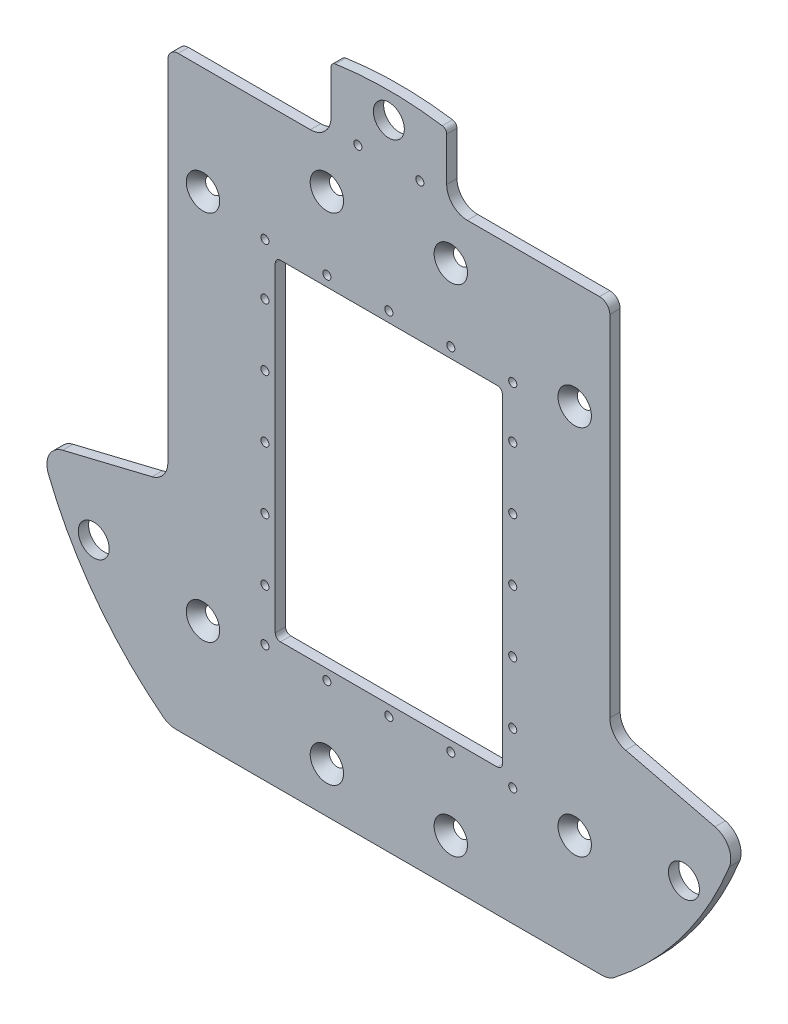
ISO-10303-21;
HEADER;
FILE_DESCRIPTION(('STEP AP214'),'2;1');
FILE_NAME('part.step','',(''),(''),'','','');
FILE_SCHEMA(('AUTOMOTIVE_DESIGN { 1 0 10303 214 1 1 1 1 }'));
ENDSEC;
DATA;
#1=APPLICATION_CONTEXT('core data for automotive mechanical design processes');
#2=APPLICATION_PROTOCOL_DEFINITION('international standard','automotive_design',2000,#1);
#3=PRODUCT_CONTEXT('',#1,'mechanical');
#4=PRODUCT('Part','Part','',(#3));
#5=PRODUCT_RELATED_PRODUCT_CATEGORY('part','',(#4));
#6=PRODUCT_DEFINITION_FORMATION('','',#4);
#7=PRODUCT_DEFINITION_CONTEXT('part definition',#1,'design');
#8=PRODUCT_DEFINITION('design','',#6,#7);
#9=PRODUCT_DEFINITION_SHAPE('','',#8);
#10=(LENGTH_UNIT() NAMED_UNIT(*) SI_UNIT(.MILLI.,.METRE.));
#11=(NAMED_UNIT(*) PLANE_ANGLE_UNIT() SI_UNIT($,.RADIAN.));
#12=(NAMED_UNIT(*) SI_UNIT($,.STERADIAN.) SOLID_ANGLE_UNIT());
#13=UNCERTAINTY_MEASURE_WITH_UNIT(LENGTH_MEASURE(1.E-05),#10,'distance_accuracy_value','');
#14=(GEOMETRIC_REPRESENTATION_CONTEXT(3) GLOBAL_UNCERTAINTY_ASSIGNED_CONTEXT((#13)) GLOBAL_UNIT_ASSIGNED_CONTEXT((#10,
#11,#12)) REPRESENTATION_CONTEXT('',''));
#15=CARTESIAN_POINT('',(0.,0.,0.));
#16=DIRECTION('',(0.,0.,1.));
#17=DIRECTION('',(1.,0.,0.));
#18=AXIS2_PLACEMENT_3D('',#15,#16,#17);
#19=CARTESIAN_POINT('',(-135.89,127.,3.175));
#20=DIRECTION('',(-1.,0.,0.));
#21=DIRECTION('',(0.,0.,1.));
#22=AXIS2_PLACEMENT_3D('',#19,#20,#21);
#23=PLANE('',#22);
#24=DIRECTION('',(0.,1.,0.));
#25=VECTOR('',#24,1.);
#26=CARTESIAN_POINT('',(-135.89,127.,3.175));
#27=LINE('',#26,#25);
#28=CARTESIAN_POINT('',(-135.89,-40.8151616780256,3.175));
#29=VERTEX_POINT('',#28);
#30=CARTESIAN_POINT('',(-135.89,173.99,3.175));
#31=VERTEX_POINT('',#30);
#32=EDGE_CURVE('E328',#29,#31,#27,.T.);
#33=ORIENTED_EDGE('',*,*,#32,.T.);
#34=DIRECTION('',(0.,0.,1.));
#35=VECTOR('',#34,1.);
#36=CARTESIAN_POINT('',(-135.89,173.99,-3.175));
#37=LINE('',#36,#35);
#38=CARTESIAN_POINT('',(-135.89,173.99,-3.175));
#39=VERTEX_POINT('',#38);
#40=EDGE_CURVE('E274',#39,#31,#37,.T.);
#41=ORIENTED_EDGE('',*,*,#40,.F.);
#42=DIRECTION('',(0.,1.,0.));
#43=VECTOR('',#42,1.);
#44=CARTESIAN_POINT('',(-135.89,127.,-3.175));
#45=LINE('',#44,#43);
#46=CARTESIAN_POINT('',(-135.89,-40.8151616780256,-3.175));
#47=VERTEX_POINT('',#46);
#48=EDGE_CURVE('E312',#47,#39,#45,.T.);
#49=ORIENTED_EDGE('',*,*,#48,.F.);
#50=DIRECTION('',(0.,0.,-1.));
#51=VECTOR('',#50,1.);
#52=CARTESIAN_POINT('',(-135.89,-40.8151616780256,3.175));
#53=LINE('',#52,#51);
#54=EDGE_CURVE('E519',#47,#29,#53,.F.);
#55=ORIENTED_EDGE('',*,*,#54,.T.);
#56=EDGE_LOOP('',(#33,#41,#49,#55));
#57=FACE_BOUND('',#56,.T.);
#58=ADVANCED_FACE('F56',(#57),#23,.T.);
#59=CARTESIAN_POINT('',(35.56,180.34,3.175));
#60=DIRECTION('',(0.,1.,0.));
#61=DIRECTION('',(0.,0.,1.));
#62=AXIS2_PLACEMENT_3D('',#59,#60,#61);
#63=PLANE('',#62);
#64=DIRECTION('',(1.,0.,0.));
#65=VECTOR('',#64,1.);
#66=CARTESIAN_POINT('',(35.56,180.34,3.175));
#67=LINE('',#66,#65);
#68=CARTESIAN_POINT('',(48.26,180.34,3.175));
#69=VERTEX_POINT('',#68);
#70=CARTESIAN_POINT('',(129.54,180.34,3.175));
#71=VERTEX_POINT('',#70);
#72=EDGE_CURVE('E309',#69,#71,#67,.T.);
#73=ORIENTED_EDGE('',*,*,#72,.T.);
#74=DIRECTION('',(0.,0.,1.));
#75=VECTOR('',#74,1.);
#76=CARTESIAN_POINT('',(129.54,180.34,-3.175));
#77=LINE('',#76,#75);
#78=CARTESIAN_POINT('',(129.54,180.34,-3.175));
#79=VERTEX_POINT('',#78);
#80=EDGE_CURVE('E268',#79,#71,#77,.T.);
#81=ORIENTED_EDGE('',*,*,#80,.F.);
#82=DIRECTION('',(1.,0.,0.));
#83=VECTOR('',#82,1.);
#84=CARTESIAN_POINT('',(35.56,180.34,-3.175));
#85=LINE('',#84,#83);
#86=CARTESIAN_POINT('',(48.26,180.34,-3.175));
#87=VERTEX_POINT('',#86);
#88=EDGE_CURVE('E292',#87,#79,#85,.T.);
#89=ORIENTED_EDGE('',*,*,#88,.F.);
#90=DIRECTION('',(0.,0.,-1.));
#91=VECTOR('',#90,1.);
#92=CARTESIAN_POINT('',(48.26,180.34,3.175));
#93=LINE('',#92,#91);
#94=EDGE_CURVE('E533',#87,#69,#93,.F.);
#95=ORIENTED_EDGE('',*,*,#94,.T.);
#96=EDGE_LOOP('',(#73,#81,#89,#95));
#97=FACE_BOUND('',#96,.T.);
#98=ADVANCED_FACE('F638',(#97),#63,.T.);
#99=CARTESIAN_POINT('',(0.,0.,3.175));
#100=DIRECTION('',(0.,0.,-1.));
#101=DIRECTION('',(-1.,0.,0.));
#102=AXIS2_PLACEMENT_3D('',#99,#100,#101);
#103=CYLINDRICAL_SURFACE('',#102,225.425);
#104=CARTESIAN_POINT('',(0.,0.,-3.175));
#105=DIRECTION('',(0.,0.,1.));
#106=DIRECTION('',(1.,0.,0.));
#107=AXIS2_PLACEMENT_3D('',#104,#105,#106);
#108=CIRCLE('',#107,225.425);
#109=CARTESIAN_POINT('',(-209.367396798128,-83.5567099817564,-3.175));
#110=VERTEX_POINT('',#109);
#111=CARTESIAN_POINT('',(-138.771363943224,-177.648358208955,-3.175));
#112=VERTEX_POINT('',#111);
#113=EDGE_CURVE('E373',#110,#112,#108,.T.);
#114=ORIENTED_EDGE('',*,*,#113,.T.);
#115=DIRECTION('',(0.,0.,-1.));
#116=VECTOR('',#115,1.);
#117=CARTESIAN_POINT('',(-138.771363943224,-177.648358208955,3.175));
#118=LINE('',#117,#116);
#119=CARTESIAN_POINT('',(-138.771363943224,-177.648358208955,3.175));
#120=VERTEX_POINT('',#119);
#121=EDGE_CURVE('E588',#112,#120,#118,.F.);
#122=ORIENTED_EDGE('',*,*,#121,.T.);
#123=CARTESIAN_POINT('',(0.,0.,3.175));
#124=DIRECTION('',(0.,0.,1.));
#125=DIRECTION('',(1.,0.,0.));
#126=AXIS2_PLACEMENT_3D('',#123,#124,#125);
#127=CIRCLE('',#126,225.425);
#128=CARTESIAN_POINT('',(-209.367396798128,-83.5567099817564,3.175));
#129=VERTEX_POINT('',#128);
#130=EDGE_CURVE('E367',#129,#120,#127,.T.);
#131=ORIENTED_EDGE('',*,*,#130,.F.);
#132=DIRECTION('',(0.,0.,-1.));
#133=VECTOR('',#132,1.);
#134=CARTESIAN_POINT('',(-209.367396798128,-83.5567099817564,3.175));
#135=LINE('',#134,#133);
#136=EDGE_CURVE('E584',#129,#110,#135,.T.);
#137=ORIENTED_EDGE('',*,*,#136,.T.);
#138=EDGE_LOOP('',(#114,#122,#131,#137));
#139=FACE_BOUND('',#138,.T.);
#140=ADVANCED_FACE('F644',(#139),#103,.T.);
#141=CARTESIAN_POINT('',(138.771363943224,-177.648358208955,-3.175));
#142=VERTEX_POINT('',#141);
#143=CARTESIAN_POINT('',(209.367396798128,-83.5567099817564,-3.175));
#144=VERTEX_POINT('',#143);
#145=EDGE_CURVE('E366',#142,#144,#108,.T.);
#146=ORIENTED_EDGE('',*,*,#145,.T.);
#147=DIRECTION('',(0.,0.,-1.));
#148=VECTOR('',#147,1.);
#149=CARTESIAN_POINT('',(209.367396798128,-83.5567099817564,3.175));
#150=LINE('',#149,#148);
#151=CARTESIAN_POINT('',(209.367396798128,-83.5567099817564,3.175));
#152=VERTEX_POINT('',#151);
#153=EDGE_CURVE('E561',#144,#152,#150,.F.);
#154=ORIENTED_EDGE('',*,*,#153,.T.);
#155=CARTESIAN_POINT('',(138.771363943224,-177.648358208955,3.175));
#156=VERTEX_POINT('',#155);
#157=EDGE_CURVE('E372',#156,#152,#127,.T.);
#158=ORIENTED_EDGE('',*,*,#157,.F.);
#159=DIRECTION('',(0.,0.,-1.));
#160=VECTOR('',#159,1.);
#161=CARTESIAN_POINT('',(138.771363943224,-177.648358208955,3.175));
#162=LINE('',#161,#160);
#163=EDGE_CURVE('E558',#156,#142,#162,.T.);
#164=ORIENTED_EDGE('',*,*,#163,.T.);
#165=EDGE_LOOP('',(#146,#154,#158,#164));
#166=FACE_BOUND('',#165,.T.);
#167=ADVANCED_FACE('F672',(#166),#103,.T.);
#168=CARTESIAN_POINT('',(32.8476428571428,223.018974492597,3.175));
#169=VERTEX_POINT('',#168);
#170=CARTESIAN_POINT('',(-32.8476428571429,223.018974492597,3.175));
#171=VERTEX_POINT('',#170);
#172=EDGE_CURVE('E371',#169,#171,#127,.T.);
#173=ORIENTED_EDGE('',*,*,#172,.F.);
#174=DIRECTION('',(0.,0.,-1.));
#175=VECTOR('',#174,1.);
#176=CARTESIAN_POINT('',(32.8476428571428,223.018974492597,3.175));
#177=LINE('',#176,#175);
#178=CARTESIAN_POINT('',(32.8476428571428,223.018974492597,-3.175));
#179=VERTEX_POINT('',#178);
#180=EDGE_CURVE('E446',#169,#179,#177,.T.);
#181=ORIENTED_EDGE('',*,*,#180,.T.);
#182=CARTESIAN_POINT('',(-32.8476428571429,223.018974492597,-3.175));
#183=VERTEX_POINT('',#182);
#184=EDGE_CURVE('E377',#179,#183,#108,.T.);
#185=ORIENTED_EDGE('',*,*,#184,.T.);
#186=DIRECTION('',(0.,0.,-1.));
#187=VECTOR('',#186,1.);
#188=CARTESIAN_POINT('',(-32.8476428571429,223.018974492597,3.175));
#189=LINE('',#188,#187);
#190=EDGE_CURVE('E443',#183,#171,#189,.F.);
#191=ORIENTED_EDGE('',*,*,#190,.T.);
#192=EDGE_LOOP('',(#173,#181,#185,#191));
#193=FACE_BOUND('',#192,.T.);
#194=ADVANCED_FACE('F666',(#193),#103,.T.);
#195=CARTESIAN_POINT('',(0.,0.,3.175));
#196=DIRECTION('',(0.,0.,1.));
#197=DIRECTION('',(1.,0.,0.));
#198=AXIS2_PLACEMENT_3D('',#195,#196,#197);
#199=PLANE('',#198);
#200=CARTESIAN_POINT('',(129.54,173.99,3.175));
#201=DIRECTION('',(0.,0.,-1.));
#202=DIRECTION('',(-1.,0.,0.));
#203=AXIS2_PLACEMENT_3D('',#200,#201,#202);
#204=CIRCLE('',#203,6.34999999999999);
#205=CARTESIAN_POINT('',(135.89,173.99,3.175));
#206=VERTEX_POINT('',#205);
#207=EDGE_CURVE('E264',#71,#206,#204,.T.);
#208=ORIENTED_EDGE('',*,*,#207,.F.);
#209=ORIENTED_EDGE('',*,*,#72,.F.);
#210=CARTESIAN_POINT('',(48.26,193.04,3.175));
#211=DIRECTION('',(0.,0.,1.));
#212=DIRECTION('',(1.,0.,0.));
#213=AXIS2_PLACEMENT_3D('',#210,#211,#212);
#214=CIRCLE('',#213,12.7);
#215=CARTESIAN_POINT('',(35.56,193.04,3.175));
#216=VERTEX_POINT('',#215);
#217=EDGE_CURVE('E607',#69,#216,#214,.F.);
#218=ORIENTED_EDGE('',*,*,#217,.T.);
#219=DIRECTION('',(0.,-1.,0.));
#220=VECTOR('',#219,1.);
#221=CARTESIAN_POINT('',(35.56,226.817911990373,3.175));
#222=LINE('',#221,#220);
#223=CARTESIAN_POINT('',(35.56,219.8778621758,3.175));
#224=VERTEX_POINT('',#223);
#225=EDGE_CURVE('E299',#224,#216,#222,.T.);
#226=ORIENTED_EDGE('',*,*,#225,.F.);
#227=CARTESIAN_POINT('',(32.385,219.8778621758,3.175));
#228=DIRECTION('',(0.,0.,1.));
#229=DIRECTION('',(1.,0.,0.));
#230=AXIS2_PLACEMENT_3D('',#227,#228,#229);
#231=CIRCLE('',#230,3.175);
#232=EDGE_CURVE('E440',#224,#169,#231,.T.);
#233=ORIENTED_EDGE('',*,*,#232,.T.);
#234=ORIENTED_EDGE('',*,*,#172,.T.);
#235=CARTESIAN_POINT('',(-32.385,219.8778621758,3.175));
#236=DIRECTION('',(0.,0.,1.));
#237=DIRECTION('',(1.,0.,0.));
#238=AXIS2_PLACEMENT_3D('',#235,#236,#237);
#239=CIRCLE('',#238,3.175);
#240=CARTESIAN_POINT('',(-35.56,219.8778621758,3.175));
#241=VERTEX_POINT('',#240);
#242=EDGE_CURVE('E436',#171,#241,#239,.T.);
#243=ORIENTED_EDGE('',*,*,#242,.T.);
#244=DIRECTION('',(0.,1.,0.));
#245=VECTOR('',#244,1.);
#246=CARTESIAN_POINT('',(-35.56,224.405483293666,3.175));
#247=LINE('',#246,#245);
#248=CARTESIAN_POINT('',(-35.56,193.04,3.175));
#249=VERTEX_POINT('',#248);
#250=EDGE_CURVE('E335',#249,#241,#247,.T.);
#251=ORIENTED_EDGE('',*,*,#250,.F.);
#252=CARTESIAN_POINT('',(-48.26,193.04,3.175));
#253=DIRECTION('',(0.,0.,1.));
#254=DIRECTION('',(1.,0.,0.));
#255=AXIS2_PLACEMENT_3D('',#252,#253,#254);
#256=CIRCLE('',#255,12.7);
#257=CARTESIAN_POINT('',(-48.26,180.34,3.175));
#258=VERTEX_POINT('',#257);
#259=EDGE_CURVE('E600',#249,#258,#256,.F.);
#260=ORIENTED_EDGE('',*,*,#259,.T.);
#261=DIRECTION('',(1.,0.,0.));
#262=VECTOR('',#261,1.);
#263=CARTESIAN_POINT('',(-35.56,180.34,3.175));
#264=LINE('',#263,#262);
#265=CARTESIAN_POINT('',(-129.54,180.34,3.175));
#266=VERTEX_POINT('',#265);
#267=EDGE_CURVE('E332',#266,#258,#264,.T.);
#268=ORIENTED_EDGE('',*,*,#267,.F.);
#269=CARTESIAN_POINT('',(-129.54,173.99,3.175));
#270=DIRECTION('',(0.,0.,-1.));
#271=DIRECTION('',(1.,0.,0.));
#272=AXIS2_PLACEMENT_3D('',#269,#270,#271);
#273=CIRCLE('',#272,6.34999999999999);
#274=EDGE_CURVE('E72',#31,#266,#273,.T.);
#275=ORIENTED_EDGE('',*,*,#274,.F.);
#276=ORIENTED_EDGE('',*,*,#32,.F.);
#277=CARTESIAN_POINT('',(-148.59,-40.8151616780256,3.175));
#278=DIRECTION('',(0.,0.,1.));
#279=DIRECTION('',(1.,0.,0.));
#280=AXIS2_PLACEMENT_3D('',#277,#278,#279);
#281=CIRCLE('',#280,12.7);
#282=CARTESIAN_POINT('',(-145.592796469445,-53.1564246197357,3.175));
#283=VERTEX_POINT('',#282);
#284=EDGE_CURVE('E594',#29,#283,#281,.F.);
#285=ORIENTED_EDGE('',*,*,#284,.T.);
#286=DIRECTION('',(0.971752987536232,0.236000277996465,0.));
#287=VECTOR('',#286,1.);
#288=CARTESIAN_POINT('',(-135.89,-50.8,3.175));
#289=LINE('',#288,#287);
#290=CARTESIAN_POINT('',(-200.569254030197,-66.5080267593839,3.175));
#291=VERTEX_POINT('',#290);
#292=EDGE_CURVE('E338',#291,#283,#289,.T.);
#293=ORIENTED_EDGE('',*,*,#292,.F.);
#294=CARTESIAN_POINT('',(-197.572050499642,-78.8492897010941,3.175));
#295=DIRECTION('',(0.,0.,1.));
#296=DIRECTION('',(1.,0.,0.));
#297=AXIS2_PLACEMENT_3D('',#294,#295,#296);
#298=CIRCLE('',#297,12.7);
#299=EDGE_CURVE('E564',#291,#129,#298,.T.);
#300=ORIENTED_EDGE('',*,*,#299,.T.);
#301=ORIENTED_EDGE('',*,*,#130,.T.);
#302=CARTESIAN_POINT('',(-130.953258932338,-167.64,3.175));
#303=DIRECTION('',(0.,0.,1.));
#304=DIRECTION('',(1.,0.,0.));
#305=AXIS2_PLACEMENT_3D('',#302,#303,#304);
#306=CIRCLE('',#305,12.7);
#307=CARTESIAN_POINT('',(-130.953258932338,-180.34,3.175));
#308=VERTEX_POINT('',#307);
#309=EDGE_CURVE('E567',#120,#308,#306,.T.);
#310=ORIENTED_EDGE('',*,*,#309,.T.);
#311=DIRECTION('',(-1.,0.,0.));
#312=VECTOR('',#311,1.);
#313=CARTESIAN_POINT('',(-353.789041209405,-180.34,3.175));
#314=LINE('',#313,#312);
#315=CARTESIAN_POINT('',(130.953258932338,-180.34,3.175));
#316=VERTEX_POINT('',#315);
#317=EDGE_CURVE('E313',#316,#308,#314,.T.);
#318=ORIENTED_EDGE('',*,*,#317,.F.);
#319=CARTESIAN_POINT('',(130.953258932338,-167.64,3.175));
#320=DIRECTION('',(0.,0.,1.));
#321=DIRECTION('',(1.,0.,0.));
#322=AXIS2_PLACEMENT_3D('',#319,#320,#321);
#323=CIRCLE('',#322,12.7);
#324=EDGE_CURVE('E570',#316,#156,#323,.T.);
#325=ORIENTED_EDGE('',*,*,#324,.T.);
#326=ORIENTED_EDGE('',*,*,#157,.T.);
#327=CARTESIAN_POINT('',(197.572050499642,-78.8492897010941,3.175));
#328=DIRECTION('',(0.,0.,1.));
#329=DIRECTION('',(1.,0.,0.));
#330=AXIS2_PLACEMENT_3D('',#327,#328,#329);
#331=CIRCLE('',#330,12.7);
#332=CARTESIAN_POINT('',(200.569254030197,-66.5080267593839,3.175));
#333=VERTEX_POINT('',#332);
#334=EDGE_CURVE('E573',#152,#333,#331,.T.);
#335=ORIENTED_EDGE('',*,*,#334,.T.);
#336=DIRECTION('',(0.971752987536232,-0.236000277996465,0.));
#337=VECTOR('',#336,1.);
#338=CARTESIAN_POINT('',(135.89,-50.8,3.175));
#339=LINE('',#338,#337);
#340=CARTESIAN_POINT('',(145.592796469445,-53.1564246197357,3.175));
#341=VERTEX_POINT('',#340);
#342=EDGE_CURVE('E291',#341,#333,#339,.T.);
#343=ORIENTED_EDGE('',*,*,#342,.F.);
#344=CARTESIAN_POINT('',(148.59,-40.8151616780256,3.175));
#345=DIRECTION('',(0.,0.,1.));
#346=DIRECTION('',(1.,0.,0.));
#347=AXIS2_PLACEMENT_3D('',#344,#345,#346);
#348=CIRCLE('',#347,12.7);
#349=CARTESIAN_POINT('',(135.89,-40.8151616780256,3.175));
#350=VERTEX_POINT('',#349);
#351=EDGE_CURVE('E13',#341,#350,#348,.F.);
#352=ORIENTED_EDGE('',*,*,#351,.T.);
#353=DIRECTION('',(0.,-1.,0.));
#354=VECTOR('',#353,1.);
#355=CARTESIAN_POINT('',(135.89,127.,3.175));
#356=LINE('',#355,#354);
#357=EDGE_CURVE('E280',#206,#350,#356,.T.);
#358=ORIENTED_EDGE('',*,*,#357,.F.);
#359=EDGE_LOOP('',(#208,#209,#218,#226,#233,#234,#243,#251,#260,#268,#275,#276,#285,#293,#300,
#301,#310,#318,#325,#326,#335,#343,#352,#358));
#360=FACE_BOUND('',#359,.T.);
#361=CARTESIAN_POINT('',(-76.2,76.2,3.175));
#362=DIRECTION('',(0.,0.,1.));
#363=DIRECTION('',(1.,0.,0.));
#364=AXIS2_PLACEMENT_3D('',#361,#362,#363);
#365=CIRCLE('',#364,2.4892);
#366=CARTESIAN_POINT('',(-73.7108,76.2,3.175));
#367=VERTEX_POINT('',#366);
#368=EDGE_CURVE('E786',#367,#367,#365,.T.);
#369=ORIENTED_EDGE('',*,*,#368,.F.);
#370=EDGE_LOOP('',(#369));
#371=FACE_BOUND('',#370,.T.);
#372=CARTESIAN_POINT('',(-76.2,38.1,3.175));
#373=DIRECTION('',(0.,0.,1.));
#374=DIRECTION('',(1.,0.,0.));
#375=AXIS2_PLACEMENT_3D('',#372,#373,#374);
#376=CIRCLE('',#375,2.4892);
#377=CARTESIAN_POINT('',(-73.7108,38.1,3.175));
#378=VERTEX_POINT('',#377);
#379=EDGE_CURVE('E794',#378,#378,#376,.T.);
#380=ORIENTED_EDGE('',*,*,#379,.F.);
#381=EDGE_LOOP('',(#380));
#382=FACE_BOUND('',#381,.T.);
#383=CARTESIAN_POINT('',(-76.2,107.95,3.175));
#384=DIRECTION('',(0.,0.,1.));
#385=DIRECTION('',(1.,0.,0.));
#386=AXIS2_PLACEMENT_3D('',#383,#384,#385);
#387=CIRCLE('',#386,2.4892);
#388=CARTESIAN_POINT('',(-73.7108,107.95,3.175));
#389=VERTEX_POINT('',#388);
#390=EDGE_CURVE('E802',#389,#389,#387,.T.);
#391=ORIENTED_EDGE('',*,*,#390,.F.);
#392=EDGE_LOOP('',(#391));
#393=FACE_BOUND('',#392,.T.);
#394=CARTESIAN_POINT('',(-38.1,107.95,3.175));
#395=DIRECTION('',(0.,0.,1.));
#396=DIRECTION('',(1.,0.,0.));
#397=AXIS2_PLACEMENT_3D('',#394,#395,#396);
#398=CIRCLE('',#397,2.4892);
#399=CARTESIAN_POINT('',(-35.6108,107.95,3.175));
#400=VERTEX_POINT('',#399);
#401=EDGE_CURVE('E810',#400,#400,#398,.T.);
#402=ORIENTED_EDGE('',*,*,#401,.F.);
#403=EDGE_LOOP('',(#402));
#404=FACE_BOUND('',#403,.T.);
#405=CARTESIAN_POINT('',(0.,107.95,3.175));
#406=DIRECTION('',(0.,0.,1.));
#407=DIRECTION('',(1.,0.,0.));
#408=AXIS2_PLACEMENT_3D('',#405,#406,#407);
#409=CIRCLE('',#408,2.4892);
#410=CARTESIAN_POINT('',(2.48919999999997,107.95,3.175));
#411=VERTEX_POINT('',#410);
#412=EDGE_CURVE('E818',#411,#411,#409,.T.);
#413=ORIENTED_EDGE('',*,*,#412,.F.);
#414=EDGE_LOOP('',(#413));
#415=FACE_BOUND('',#414,.T.);
#416=CARTESIAN_POINT('',(38.1,107.95,3.175));
#417=DIRECTION('',(0.,0.,1.));
#418=DIRECTION('',(1.,0.,0.));
#419=AXIS2_PLACEMENT_3D('',#416,#417,#418);
#420=CIRCLE('',#419,2.4892);
#421=CARTESIAN_POINT('',(40.5892,107.95,3.175));
#422=VERTEX_POINT('',#421);
#423=EDGE_CURVE('E826',#422,#422,#420,.T.);
#424=ORIENTED_EDGE('',*,*,#423,.F.);
#425=EDGE_LOOP('',(#424));
#426=FACE_BOUND('',#425,.T.);
#427=CARTESIAN_POINT('',(76.2,107.95,3.175));
#428=DIRECTION('',(0.,0.,1.));
#429=DIRECTION('',(1.,0.,0.));
#430=AXIS2_PLACEMENT_3D('',#427,#428,#429);
#431=CIRCLE('',#430,2.4892);
#432=CARTESIAN_POINT('',(78.6892,107.95,3.175));
#433=VERTEX_POINT('',#432);
#434=EDGE_CURVE('E834',#433,#433,#431,.T.);
#435=ORIENTED_EDGE('',*,*,#434,.F.);
#436=EDGE_LOOP('',(#435));
#437=FACE_BOUND('',#436,.T.);
#438=CARTESIAN_POINT('',(76.2,76.2,3.175));
#439=DIRECTION('',(0.,0.,1.));
#440=DIRECTION('',(1.,0.,0.));
#441=AXIS2_PLACEMENT_3D('',#438,#439,#440);
#442=CIRCLE('',#441,2.4892);
#443=CARTESIAN_POINT('',(78.6892,76.2,3.175));
#444=VERTEX_POINT('',#443);
#445=EDGE_CURVE('E842',#444,#444,#442,.T.);
#446=ORIENTED_EDGE('',*,*,#445,.F.);
#447=EDGE_LOOP('',(#446));
#448=FACE_BOUND('',#447,.T.);
#449=CARTESIAN_POINT('',(76.2,38.1,3.175));
#450=DIRECTION('',(0.,0.,1.));
#451=DIRECTION('',(1.,0.,0.));
#452=AXIS2_PLACEMENT_3D('',#449,#450,#451);
#453=CIRCLE('',#452,2.4892);
#454=CARTESIAN_POINT('',(78.6892,38.1,3.175));
#455=VERTEX_POINT('',#454);
#456=EDGE_CURVE('E850',#455,#455,#453,.T.);
#457=ORIENTED_EDGE('',*,*,#456,.F.);
#458=EDGE_LOOP('',(#457));
#459=FACE_BOUND('',#458,.T.);
#460=CARTESIAN_POINT('',(76.2,0.,3.175));
#461=DIRECTION('',(0.,0.,1.));
#462=DIRECTION('',(1.,0.,0.));
#463=AXIS2_PLACEMENT_3D('',#460,#461,#462);
#464=CIRCLE('',#463,2.4892);
#465=CARTESIAN_POINT('',(78.6892,0.,3.175));
#466=VERTEX_POINT('',#465);
#467=EDGE_CURVE('E858',#466,#466,#464,.T.);
#468=ORIENTED_EDGE('',*,*,#467,.F.);
#469=EDGE_LOOP('',(#468));
#470=FACE_BOUND('',#469,.T.);
#471=CARTESIAN_POINT('',(76.2,-38.1,3.175));
#472=DIRECTION('',(0.,0.,1.));
#473=DIRECTION('',(1.,0.,0.));
#474=AXIS2_PLACEMENT_3D('',#471,#472,#473);
#475=CIRCLE('',#474,2.4892);
#476=CARTESIAN_POINT('',(78.6892,-38.1,3.175));
#477=VERTEX_POINT('',#476);
#478=EDGE_CURVE('E866',#477,#477,#475,.T.);
#479=ORIENTED_EDGE('',*,*,#478,.F.);
#480=EDGE_LOOP('',(#479));
#481=FACE_BOUND('',#480,.T.);
#482=CARTESIAN_POINT('',(76.2,-76.2,3.175));
#483=DIRECTION('',(0.,0.,1.));
#484=DIRECTION('',(1.,0.,0.));
#485=AXIS2_PLACEMENT_3D('',#482,#483,#484);
#486=CIRCLE('',#485,2.4892);
#487=CARTESIAN_POINT('',(78.6892,-76.2,3.175));
#488=VERTEX_POINT('',#487);
#489=EDGE_CURVE('E874',#488,#488,#486,.T.);
#490=ORIENTED_EDGE('',*,*,#489,.F.);
#491=EDGE_LOOP('',(#490));
#492=FACE_BOUND('',#491,.T.);
#493=CARTESIAN_POINT('',(76.2,-107.95,3.175));
#494=DIRECTION('',(0.,0.,1.));
#495=DIRECTION('',(1.,0.,0.));
#496=AXIS2_PLACEMENT_3D('',#493,#494,#495);
#497=CIRCLE('',#496,2.4892);
#498=CARTESIAN_POINT('',(78.6892,-107.95,3.175));
#499=VERTEX_POINT('',#498);
#500=EDGE_CURVE('E882',#499,#499,#497,.T.);
#501=ORIENTED_EDGE('',*,*,#500,.F.);
#502=EDGE_LOOP('',(#501));
#503=FACE_BOUND('',#502,.T.);
#504=CARTESIAN_POINT('',(38.1,-107.95,3.175));
#505=DIRECTION('',(0.,0.,1.));
#506=DIRECTION('',(1.,0.,0.));
#507=AXIS2_PLACEMENT_3D('',#504,#505,#506);
#508=CIRCLE('',#507,2.4892);
#509=CARTESIAN_POINT('',(40.5892,-107.95,3.175));
#510=VERTEX_POINT('',#509);
#511=EDGE_CURVE('E890',#510,#510,#508,.T.);
#512=ORIENTED_EDGE('',*,*,#511,.F.);
#513=EDGE_LOOP('',(#512));
#514=FACE_BOUND('',#513,.T.);
#515=CARTESIAN_POINT('',(0.,-107.95,3.175));
#516=DIRECTION('',(0.,0.,1.));
#517=DIRECTION('',(1.,0.,0.));
#518=AXIS2_PLACEMENT_3D('',#515,#516,#517);
#519=CIRCLE('',#518,2.4892);
#520=CARTESIAN_POINT('',(2.48920000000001,-107.95,3.175));
#521=VERTEX_POINT('',#520);
#522=EDGE_CURVE('E898',#521,#521,#519,.T.);
#523=ORIENTED_EDGE('',*,*,#522,.F.);
#524=EDGE_LOOP('',(#523));
#525=FACE_BOUND('',#524,.T.);
#526=CARTESIAN_POINT('',(-38.1,-107.95,3.175));
#527=DIRECTION('',(0.,0.,1.));
#528=DIRECTION('',(1.,0.,0.));
#529=AXIS2_PLACEMENT_3D('',#526,#527,#528);
#530=CIRCLE('',#529,2.4892);
#531=CARTESIAN_POINT('',(-35.6108,-107.95,3.175));
#532=VERTEX_POINT('',#531);
#533=EDGE_CURVE('E906',#532,#532,#530,.T.);
#534=ORIENTED_EDGE('',*,*,#533,.F.);
#535=EDGE_LOOP('',(#534));
#536=FACE_BOUND('',#535,.T.);
#537=CARTESIAN_POINT('',(-76.2,-107.95,3.175));
#538=DIRECTION('',(0.,0.,1.));
#539=DIRECTION('',(1.,0.,0.));
#540=AXIS2_PLACEMENT_3D('',#537,#538,#539);
#541=CIRCLE('',#540,2.4892);
#542=CARTESIAN_POINT('',(-73.7108,-107.95,3.175));
#543=VERTEX_POINT('',#542);
#544=EDGE_CURVE('E914',#543,#543,#541,.T.);
#545=ORIENTED_EDGE('',*,*,#544,.F.);
#546=EDGE_LOOP('',(#545));
#547=FACE_BOUND('',#546,.T.);
#548=CARTESIAN_POINT('',(-76.2,-76.2,3.175));
#549=DIRECTION('',(0.,0.,1.));
#550=DIRECTION('',(1.,0.,0.));
#551=AXIS2_PLACEMENT_3D('',#548,#549,#550);
#552=CIRCLE('',#551,2.4892);
#553=CARTESIAN_POINT('',(-73.7108,-76.2,3.175));
#554=VERTEX_POINT('',#553);
#555=EDGE_CURVE('E922',#554,#554,#552,.T.);
#556=ORIENTED_EDGE('',*,*,#555,.F.);
#557=EDGE_LOOP('',(#556));
#558=FACE_BOUND('',#557,.T.);
#559=CARTESIAN_POINT('',(-76.2,-38.1,3.175));
#560=DIRECTION('',(0.,0.,1.));
#561=DIRECTION('',(1.,0.,0.));
#562=AXIS2_PLACEMENT_3D('',#559,#560,#561);
#563=CIRCLE('',#562,2.4892);
#564=CARTESIAN_POINT('',(-73.7108,-38.1,3.175));
#565=VERTEX_POINT('',#564);
#566=EDGE_CURVE('E930',#565,#565,#563,.T.);
#567=ORIENTED_EDGE('',*,*,#566,.F.);
#568=EDGE_LOOP('',(#567));
#569=FACE_BOUND('',#568,.T.);
#570=CARTESIAN_POINT('',(-76.2,0.,3.175));
#571=DIRECTION('',(0.,0.,1.));
#572=DIRECTION('',(1.,0.,0.));
#573=AXIS2_PLACEMENT_3D('',#570,#571,#572);
#574=CIRCLE('',#573,2.4892);
#575=CARTESIAN_POINT('',(-73.7108,0.,3.175));
#576=VERTEX_POINT('',#575);
#577=EDGE_CURVE('E938',#576,#576,#574,.T.);
#578=ORIENTED_EDGE('',*,*,#577,.F.);
#579=EDGE_LOOP('',(#578));
#580=FACE_BOUND('',#579,.T.);
#581=CARTESIAN_POINT('',(19.05,186.69,3.175));
#582=DIRECTION('',(0.,0.,1.));
#583=DIRECTION('',(1.,0.,0.));
#584=AXIS2_PLACEMENT_3D('',#581,#582,#583);
#585=CIRCLE('',#584,2.4892);
#586=CARTESIAN_POINT('',(21.5392,186.69,3.175));
#587=VERTEX_POINT('',#586);
#588=EDGE_CURVE('E946',#587,#587,#585,.T.);
#589=ORIENTED_EDGE('',*,*,#588,.F.);
#590=EDGE_LOOP('',(#589));
#591=FACE_BOUND('',#590,.T.);
#592=CARTESIAN_POINT('',(-19.05,186.69,3.175));
#593=DIRECTION('',(0.,0.,1.));
#594=DIRECTION('',(1.,0.,0.));
#595=AXIS2_PLACEMENT_3D('',#592,#593,#594);
#596=CIRCLE('',#595,2.4892);
#597=CARTESIAN_POINT('',(-16.5608,186.69,3.175));
#598=VERTEX_POINT('',#597);
#599=EDGE_CURVE('E954',#598,#598,#596,.T.);
#600=ORIENTED_EDGE('',*,*,#599,.F.);
#601=EDGE_LOOP('',(#600));
#602=FACE_BOUND('',#601,.T.);
#603=CARTESIAN_POINT('',(-38.1,152.4,3.175));
#604=DIRECTION('',(0.,0.,1.));
#605=DIRECTION('',(1.,0.,0.));
#606=AXIS2_PLACEMENT_3D('',#603,#604,#605);
#607=CIRCLE('',#606,10.2724839);
#608=CARTESIAN_POINT('',(-27.8275161,152.4,3.175));
#609=VERTEX_POINT('',#608);
#610=EDGE_CURVE('E432',#609,#609,#607,.T.);
#611=ORIENTED_EDGE('',*,*,#610,.F.);
#612=EDGE_LOOP('',(#611));
#613=FACE_BOUND('',#612,.T.);
#614=CARTESIAN_POINT('',(38.1,152.4,3.175));
#615=DIRECTION('',(0.,0.,1.));
#616=DIRECTION('',(1.,0.,0.));
#617=AXIS2_PLACEMENT_3D('',#614,#615,#616);
#618=CIRCLE('',#617,10.2724839);
#619=CARTESIAN_POINT('',(48.3724839,152.4,3.175));
#620=VERTEX_POINT('',#619);
#621=EDGE_CURVE('E427',#620,#620,#618,.T.);
#622=ORIENTED_EDGE('',*,*,#621,.F.);
#623=EDGE_LOOP('',(#622));
#624=FACE_BOUND('',#623,.T.);
#625=CARTESIAN_POINT('',(-114.3,114.3,3.175));
#626=DIRECTION('',(0.,0.,1.));
#627=DIRECTION('',(1.,0.,0.));
#628=AXIS2_PLACEMENT_3D('',#625,#626,#627);
#629=CIRCLE('',#628,10.2724839);
#630=CARTESIAN_POINT('',(-104.0275161,114.3,3.175));
#631=VERTEX_POINT('',#630);
#632=EDGE_CURVE('E422',#631,#631,#629,.T.);
#633=ORIENTED_EDGE('',*,*,#632,.F.);
#634=EDGE_LOOP('',(#633));
#635=FACE_BOUND('',#634,.T.);
#636=CARTESIAN_POINT('',(114.3,114.3,3.175));
#637=DIRECTION('',(0.,0.,1.));
#638=DIRECTION('',(1.,0.,0.));
#639=AXIS2_PLACEMENT_3D('',#636,#637,#638);
#640=CIRCLE('',#639,10.2724839);
#641=CARTESIAN_POINT('',(124.5724839,114.3,3.175));
#642=VERTEX_POINT('',#641);
#643=EDGE_CURVE('E417',#642,#642,#640,.T.);
#644=ORIENTED_EDGE('',*,*,#643,.F.);
#645=EDGE_LOOP('',(#644));
#646=FACE_BOUND('',#645,.T.);
#647=CARTESIAN_POINT('',(-38.1,-152.4,3.175));
#648=DIRECTION('',(0.,0.,1.));
#649=DIRECTION('',(1.,0.,0.));
#650=AXIS2_PLACEMENT_3D('',#647,#648,#649);
#651=CIRCLE('',#650,10.2724839);
#652=CARTESIAN_POINT('',(-27.8275161,-152.4,3.175));
#653=VERTEX_POINT('',#652);
#654=EDGE_CURVE('E412',#653,#653,#651,.T.);
#655=ORIENTED_EDGE('',*,*,#654,.F.);
#656=EDGE_LOOP('',(#655));
#657=FACE_BOUND('',#656,.T.);
#658=CARTESIAN_POINT('',(38.1,-152.4,3.175));
#659=DIRECTION('',(0.,0.,1.));
#660=DIRECTION('',(1.,0.,0.));
#661=AXIS2_PLACEMENT_3D('',#658,#659,#660);
#662=CIRCLE('',#661,10.2724839);
#663=CARTESIAN_POINT('',(48.3724839,-152.4,3.175));
#664=VERTEX_POINT('',#663);
#665=EDGE_CURVE('E407',#664,#664,#662,.T.);
#666=ORIENTED_EDGE('',*,*,#665,.F.);
#667=EDGE_LOOP('',(#666));
#668=FACE_BOUND('',#667,.T.);
#669=CARTESIAN_POINT('',(-114.3,-114.3,3.175));
#670=DIRECTION('',(0.,0.,1.));
#671=DIRECTION('',(1.,0.,0.));
#672=AXIS2_PLACEMENT_3D('',#669,#670,#671);
#673=CIRCLE('',#672,10.2724839);
#674=CARTESIAN_POINT('',(-104.0275161,-114.3,3.175));
#675=VERTEX_POINT('',#674);
#676=EDGE_CURVE('E402',#675,#675,#673,.T.);
#677=ORIENTED_EDGE('',*,*,#676,.F.);
#678=EDGE_LOOP('',(#677));
#679=FACE_BOUND('',#678,.T.);
#680=CARTESIAN_POINT('',(114.3,-114.3,3.175));
#681=DIRECTION('',(0.,0.,1.));
#682=DIRECTION('',(1.,0.,0.));
#683=AXIS2_PLACEMENT_3D('',#680,#681,#682);
#684=CIRCLE('',#683,10.2724839);
#685=CARTESIAN_POINT('',(124.5724839,-114.3,3.175));
#686=VERTEX_POINT('',#685);
#687=EDGE_CURVE('E397',#686,#686,#684,.T.);
#688=ORIENTED_EDGE('',*,*,#687,.F.);
#689=EDGE_LOOP('',(#688));
#690=FACE_BOUND('',#689,.T.);
#691=DIRECTION('',(0.,1.,0.));
#692=VECTOR('',#691,1.);
#693=CARTESIAN_POINT('',(69.85,-101.6,3.175));
#694=LINE('',#693,#692);
#695=CARTESIAN_POINT('',(69.85,-98.425,3.175));
#696=VERTEX_POINT('',#695);
#697=CARTESIAN_POINT('',(69.85,98.425,3.175));
#698=VERTEX_POINT('',#697);
#699=EDGE_CURVE('E396',#696,#698,#694,.T.);
#700=ORIENTED_EDGE('',*,*,#699,.F.);
#701=CARTESIAN_POINT('',(66.675,-98.425,3.175));
#702=DIRECTION('',(0.,0.,1.));
#703=DIRECTION('',(1.,0.,0.));
#704=AXIS2_PLACEMENT_3D('',#701,#702,#703);
#705=CIRCLE('',#704,3.175);
#706=CARTESIAN_POINT('',(66.675,-101.6,3.175));
#707=VERTEX_POINT('',#706);
#708=EDGE_CURVE('E506',#696,#707,#705,.F.);
#709=ORIENTED_EDGE('',*,*,#708,.T.);
#710=DIRECTION('',(1.,0.,0.));
#711=VECTOR('',#710,1.);
#712=CARTESIAN_POINT('',(-69.85,-101.6,3.175));
#713=LINE('',#712,#711);
#714=CARTESIAN_POINT('',(-66.675,-101.6,3.175));
#715=VERTEX_POINT('',#714);
#716=EDGE_CURVE('E991',#715,#707,#713,.T.);
#717=ORIENTED_EDGE('',*,*,#716,.F.);
#718=CARTESIAN_POINT('',(-66.675,-98.425,3.175));
#719=DIRECTION('',(0.,0.,1.));
#720=DIRECTION('',(1.,0.,0.));
#721=AXIS2_PLACEMENT_3D('',#718,#719,#720);
#722=CIRCLE('',#721,3.175);
#723=CARTESIAN_POINT('',(-69.85,-98.425,3.175));
#724=VERTEX_POINT('',#723);
#725=EDGE_CURVE('E488',#715,#724,#722,.F.);
#726=ORIENTED_EDGE('',*,*,#725,.T.);
#727=DIRECTION('',(0.,-1.,0.));
#728=VECTOR('',#727,1.);
#729=CARTESIAN_POINT('',(-69.85,-101.6,3.175));
#730=LINE('',#729,#728);
#731=CARTESIAN_POINT('',(-69.85,98.425,3.175));
#732=VERTEX_POINT('',#731);
#733=EDGE_CURVE('E1009',#732,#724,#730,.T.);
#734=ORIENTED_EDGE('',*,*,#733,.F.);
#735=CARTESIAN_POINT('',(-66.675,98.425,3.175));
#736=DIRECTION('',(0.,0.,1.));
#737=DIRECTION('',(1.,0.,0.));
#738=AXIS2_PLACEMENT_3D('',#735,#736,#737);
#739=CIRCLE('',#738,3.175);
#740=CARTESIAN_POINT('',(-66.675,101.6,3.175));
#741=VERTEX_POINT('',#740);
#742=EDGE_CURVE('E494',#732,#741,#739,.F.);
#743=ORIENTED_EDGE('',*,*,#742,.T.);
#744=DIRECTION('',(-1.,0.,0.));
#745=VECTOR('',#744,1.);
#746=CARTESIAN_POINT('',(-69.85,101.6,3.175));
#747=LINE('',#746,#745);
#748=CARTESIAN_POINT('',(66.675,101.6,3.175));
#749=VERTEX_POINT('',#748);
#750=EDGE_CURVE('E1005',#749,#741,#747,.T.);
#751=ORIENTED_EDGE('',*,*,#750,.F.);
#752=CARTESIAN_POINT('',(66.675,98.425,3.175));
#753=DIRECTION('',(0.,0.,1.));
#754=DIRECTION('',(1.,0.,0.));
#755=AXIS2_PLACEMENT_3D('',#752,#753,#754);
#756=CIRCLE('',#755,3.175);
#757=EDGE_CURVE('E500',#749,#698,#756,.F.);
#758=ORIENTED_EDGE('',*,*,#757,.T.);
#759=EDGE_LOOP('',(#700,#709,#717,#726,#734,#743,#751,#758));
#760=FACE_BOUND('',#759,.T.);
#761=CARTESIAN_POINT('',(0.,209.55,3.175));
#762=DIRECTION('',(0.,0.,1.));
#763=DIRECTION('',(1.,0.,0.));
#764=AXIS2_PLACEMENT_3D('',#761,#762,#763);
#765=CIRCLE('',#764,9.525);
#766=CARTESIAN_POINT('',(9.525,209.55,3.175));
#767=VERTEX_POINT('',#766);
#768=EDGE_CURVE('E342',#767,#767,#765,.T.);
#769=ORIENTED_EDGE('',*,*,#768,.F.);
#770=EDGE_LOOP('',(#769));
#771=FACE_BOUND('',#770,.T.);
#772=CARTESIAN_POINT('',(181.475623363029,-104.775,3.175));
#773=DIRECTION('',(0.,0.,1.));
#774=DIRECTION('',(1.,0.,0.));
#775=AXIS2_PLACEMENT_3D('',#772,#773,#774);
#776=CIRCLE('',#775,9.52500000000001);
#777=CARTESIAN_POINT('',(191.000623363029,-104.775,3.175));
#778=VERTEX_POINT('',#777);
#779=EDGE_CURVE('E350',#778,#778,#776,.T.);
#780=ORIENTED_EDGE('',*,*,#779,.F.);
#781=EDGE_LOOP('',(#780));
#782=FACE_BOUND('',#781,.T.);
#783=CARTESIAN_POINT('',(-181.47562336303,-104.774999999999,3.175));
#784=DIRECTION('',(0.,0.,1.));
#785=DIRECTION('',(1.,0.,0.));
#786=AXIS2_PLACEMENT_3D('',#783,#784,#785);
#787=CIRCLE('',#786,9.52500000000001);
#788=CARTESIAN_POINT('',(-171.95062336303,-104.774999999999,3.175));
#789=VERTEX_POINT('',#788);
#790=EDGE_CURVE('E358',#789,#789,#787,.T.);
#791=ORIENTED_EDGE('',*,*,#790,.F.);
#792=EDGE_LOOP('',(#791));
#793=FACE_BOUND('',#792,.T.);
#794=ADVANCED_FACE('F285',(#360,#371,#382,#393,#404,#415,#426,#437,#448,#459,#470,#481,#492,
#503,#514,#525,#536,#547,#558,#569,#580,#591,#602,#613,#624,#635,#646,#657,#668,#679,#690,#760,
#771,#782,#793),#199,.T.);
#795=CARTESIAN_POINT('',(0.,0.,-3.175));
#796=DIRECTION('',(0.,0.,1.));
#797=DIRECTION('',(1.,0.,0.));
#798=AXIS2_PLACEMENT_3D('',#795,#796,#797);
#799=PLANE('',#798);
#800=CARTESIAN_POINT('',(-76.2,76.2,-3.175));
#801=DIRECTION('',(0.,0.,1.));
#802=DIRECTION('',(1.,0.,0.));
#803=AXIS2_PLACEMENT_3D('',#800,#801,#802);
#804=CIRCLE('',#803,2.4892);
#805=CARTESIAN_POINT('',(-73.7108,76.2,-3.175));
#806=VERTEX_POINT('',#805);
#807=EDGE_CURVE('E790',#806,#806,#804,.T.);
#808=ORIENTED_EDGE('',*,*,#807,.T.);
#809=EDGE_LOOP('',(#808));
#810=FACE_BOUND('',#809,.T.);
#811=CARTESIAN_POINT('',(-76.2,38.1,-3.175));
#812=DIRECTION('',(0.,0.,1.));
#813=DIRECTION('',(1.,0.,0.));
#814=AXIS2_PLACEMENT_3D('',#811,#812,#813);
#815=CIRCLE('',#814,2.4892);
#816=CARTESIAN_POINT('',(-73.7108,38.1,-3.175));
#817=VERTEX_POINT('',#816);
#818=EDGE_CURVE('E798',#817,#817,#815,.T.);
#819=ORIENTED_EDGE('',*,*,#818,.T.);
#820=EDGE_LOOP('',(#819));
#821=FACE_BOUND('',#820,.T.);
#822=CARTESIAN_POINT('',(-76.2,107.95,-3.175));
#823=DIRECTION('',(0.,0.,1.));
#824=DIRECTION('',(1.,0.,0.));
#825=AXIS2_PLACEMENT_3D('',#822,#823,#824);
#826=CIRCLE('',#825,2.4892);
#827=CARTESIAN_POINT('',(-73.7108,107.95,-3.175));
#828=VERTEX_POINT('',#827);
#829=EDGE_CURVE('E806',#828,#828,#826,.T.);
#830=ORIENTED_EDGE('',*,*,#829,.T.);
#831=EDGE_LOOP('',(#830));
#832=FACE_BOUND('',#831,.T.);
#833=CARTESIAN_POINT('',(-38.1,107.95,-3.175));
#834=DIRECTION('',(0.,0.,1.));
#835=DIRECTION('',(1.,0.,0.));
#836=AXIS2_PLACEMENT_3D('',#833,#834,#835);
#837=CIRCLE('',#836,2.4892);
#838=CARTESIAN_POINT('',(-35.6108,107.95,-3.175));
#839=VERTEX_POINT('',#838);
#840=EDGE_CURVE('E814',#839,#839,#837,.T.);
#841=ORIENTED_EDGE('',*,*,#840,.T.);
#842=EDGE_LOOP('',(#841));
#843=FACE_BOUND('',#842,.T.);
#844=CARTESIAN_POINT('',(0.,107.95,-3.175));
#845=DIRECTION('',(0.,0.,1.));
#846=DIRECTION('',(1.,0.,0.));
#847=AXIS2_PLACEMENT_3D('',#844,#845,#846);
#848=CIRCLE('',#847,2.4892);
#849=CARTESIAN_POINT('',(2.48919999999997,107.95,-3.175));
#850=VERTEX_POINT('',#849);
#851=EDGE_CURVE('E822',#850,#850,#848,.T.);
#852=ORIENTED_EDGE('',*,*,#851,.T.);
#853=EDGE_LOOP('',(#852));
#854=FACE_BOUND('',#853,.T.);
#855=CARTESIAN_POINT('',(38.1,107.95,-3.175));
#856=DIRECTION('',(0.,0.,1.));
#857=DIRECTION('',(1.,0.,0.));
#858=AXIS2_PLACEMENT_3D('',#855,#856,#857);
#859=CIRCLE('',#858,2.4892);
#860=CARTESIAN_POINT('',(40.5892,107.95,-3.175));
#861=VERTEX_POINT('',#860);
#862=EDGE_CURVE('E830',#861,#861,#859,.T.);
#863=ORIENTED_EDGE('',*,*,#862,.T.);
#864=EDGE_LOOP('',(#863));
#865=FACE_BOUND('',#864,.T.);
#866=CARTESIAN_POINT('',(76.2,107.95,-3.175));
#867=DIRECTION('',(0.,0.,1.));
#868=DIRECTION('',(1.,0.,0.));
#869=AXIS2_PLACEMENT_3D('',#866,#867,#868);
#870=CIRCLE('',#869,2.4892);
#871=CARTESIAN_POINT('',(78.6892,107.95,-3.175));
#872=VERTEX_POINT('',#871);
#873=EDGE_CURVE('E838',#872,#872,#870,.T.);
#874=ORIENTED_EDGE('',*,*,#873,.T.);
#875=EDGE_LOOP('',(#874));
#876=FACE_BOUND('',#875,.T.);
#877=CARTESIAN_POINT('',(76.2,76.2,-3.175));
#878=DIRECTION('',(0.,0.,1.));
#879=DIRECTION('',(1.,0.,0.));
#880=AXIS2_PLACEMENT_3D('',#877,#878,#879);
#881=CIRCLE('',#880,2.4892);
#882=CARTESIAN_POINT('',(78.6892,76.2,-3.175));
#883=VERTEX_POINT('',#882);
#884=EDGE_CURVE('E846',#883,#883,#881,.T.);
#885=ORIENTED_EDGE('',*,*,#884,.T.);
#886=EDGE_LOOP('',(#885));
#887=FACE_BOUND('',#886,.T.);
#888=CARTESIAN_POINT('',(76.2,38.1,-3.175));
#889=DIRECTION('',(0.,0.,1.));
#890=DIRECTION('',(1.,0.,0.));
#891=AXIS2_PLACEMENT_3D('',#888,#889,#890);
#892=CIRCLE('',#891,2.4892);
#893=CARTESIAN_POINT('',(78.6892,38.1,-3.175));
#894=VERTEX_POINT('',#893);
#895=EDGE_CURVE('E854',#894,#894,#892,.T.);
#896=ORIENTED_EDGE('',*,*,#895,.T.);
#897=EDGE_LOOP('',(#896));
#898=FACE_BOUND('',#897,.T.);
#899=CARTESIAN_POINT('',(76.2,0.,-3.175));
#900=DIRECTION('',(0.,0.,1.));
#901=DIRECTION('',(1.,0.,0.));
#902=AXIS2_PLACEMENT_3D('',#899,#900,#901);
#903=CIRCLE('',#902,2.4892);
#904=CARTESIAN_POINT('',(78.6892,0.,-3.175));
#905=VERTEX_POINT('',#904);
#906=EDGE_CURVE('E862',#905,#905,#903,.T.);
#907=ORIENTED_EDGE('',*,*,#906,.T.);
#908=EDGE_LOOP('',(#907));
#909=FACE_BOUND('',#908,.T.);
#910=CARTESIAN_POINT('',(76.2,-38.1,-3.175));
#911=DIRECTION('',(0.,0.,1.));
#912=DIRECTION('',(1.,0.,0.));
#913=AXIS2_PLACEMENT_3D('',#910,#911,#912);
#914=CIRCLE('',#913,2.4892);
#915=CARTESIAN_POINT('',(78.6892,-38.1,-3.175));
#916=VERTEX_POINT('',#915);
#917=EDGE_CURVE('E870',#916,#916,#914,.T.);
#918=ORIENTED_EDGE('',*,*,#917,.T.);
#919=EDGE_LOOP('',(#918));
#920=FACE_BOUND('',#919,.T.);
#921=CARTESIAN_POINT('',(76.2,-76.2,-3.175));
#922=DIRECTION('',(0.,0.,1.));
#923=DIRECTION('',(1.,0.,0.));
#924=AXIS2_PLACEMENT_3D('',#921,#922,#923);
#925=CIRCLE('',#924,2.4892);
#926=CARTESIAN_POINT('',(78.6892,-76.2,-3.175));
#927=VERTEX_POINT('',#926);
#928=EDGE_CURVE('E878',#927,#927,#925,.T.);
#929=ORIENTED_EDGE('',*,*,#928,.T.);
#930=EDGE_LOOP('',(#929));
#931=FACE_BOUND('',#930,.T.);
#932=CARTESIAN_POINT('',(76.2,-107.95,-3.175));
#933=DIRECTION('',(0.,0.,1.));
#934=DIRECTION('',(1.,0.,0.));
#935=AXIS2_PLACEMENT_3D('',#932,#933,#934);
#936=CIRCLE('',#935,2.4892);
#937=CARTESIAN_POINT('',(78.6892,-107.95,-3.175));
#938=VERTEX_POINT('',#937);
#939=EDGE_CURVE('E886',#938,#938,#936,.T.);
#940=ORIENTED_EDGE('',*,*,#939,.T.);
#941=EDGE_LOOP('',(#940));
#942=FACE_BOUND('',#941,.T.);
#943=CARTESIAN_POINT('',(38.1,-107.95,-3.175));
#944=DIRECTION('',(0.,0.,1.));
#945=DIRECTION('',(1.,0.,0.));
#946=AXIS2_PLACEMENT_3D('',#943,#944,#945);
#947=CIRCLE('',#946,2.4892);
#948=CARTESIAN_POINT('',(40.5892,-107.95,-3.175));
#949=VERTEX_POINT('',#948);
#950=EDGE_CURVE('E894',#949,#949,#947,.T.);
#951=ORIENTED_EDGE('',*,*,#950,.T.);
#952=EDGE_LOOP('',(#951));
#953=FACE_BOUND('',#952,.T.);
#954=CARTESIAN_POINT('',(0.,-107.95,-3.175));
#955=DIRECTION('',(0.,0.,1.));
#956=DIRECTION('',(1.,0.,0.));
#957=AXIS2_PLACEMENT_3D('',#954,#955,#956);
#958=CIRCLE('',#957,2.4892);
#959=CARTESIAN_POINT('',(2.48920000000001,-107.95,-3.175));
#960=VERTEX_POINT('',#959);
#961=EDGE_CURVE('E902',#960,#960,#958,.T.);
#962=ORIENTED_EDGE('',*,*,#961,.T.);
#963=EDGE_LOOP('',(#962));
#964=FACE_BOUND('',#963,.T.);
#965=CARTESIAN_POINT('',(-38.1,-107.95,-3.175));
#966=DIRECTION('',(0.,0.,1.));
#967=DIRECTION('',(1.,0.,0.));
#968=AXIS2_PLACEMENT_3D('',#965,#966,#967);
#969=CIRCLE('',#968,2.4892);
#970=CARTESIAN_POINT('',(-35.6108,-107.95,-3.175));
#971=VERTEX_POINT('',#970);
#972=EDGE_CURVE('E910',#971,#971,#969,.T.);
#973=ORIENTED_EDGE('',*,*,#972,.T.);
#974=EDGE_LOOP('',(#973));
#975=FACE_BOUND('',#974,.T.);
#976=CARTESIAN_POINT('',(-76.2,-107.95,-3.175));
#977=DIRECTION('',(0.,0.,1.));
#978=DIRECTION('',(1.,0.,0.));
#979=AXIS2_PLACEMENT_3D('',#976,#977,#978);
#980=CIRCLE('',#979,2.4892);
#981=CARTESIAN_POINT('',(-73.7108,-107.95,-3.175));
#982=VERTEX_POINT('',#981);
#983=EDGE_CURVE('E918',#982,#982,#980,.T.);
#984=ORIENTED_EDGE('',*,*,#983,.T.);
#985=EDGE_LOOP('',(#984));
#986=FACE_BOUND('',#985,.T.);
#987=CARTESIAN_POINT('',(-76.2,-76.2,-3.175));
#988=DIRECTION('',(0.,0.,1.));
#989=DIRECTION('',(1.,0.,0.));
#990=AXIS2_PLACEMENT_3D('',#987,#988,#989);
#991=CIRCLE('',#990,2.4892);
#992=CARTESIAN_POINT('',(-73.7108,-76.2,-3.175));
#993=VERTEX_POINT('',#992);
#994=EDGE_CURVE('E926',#993,#993,#991,.T.);
#995=ORIENTED_EDGE('',*,*,#994,.T.);
#996=EDGE_LOOP('',(#995));
#997=FACE_BOUND('',#996,.T.);
#998=CARTESIAN_POINT('',(-76.2,-38.1,-3.175));
#999=DIRECTION('',(0.,0.,1.));
#1000=DIRECTION('',(1.,0.,0.));
#1001=AXIS2_PLACEMENT_3D('',#998,#999,#1000);
#1002=CIRCLE('',#1001,2.4892);
#1003=CARTESIAN_POINT('',(-73.7108,-38.1,-3.175));
#1004=VERTEX_POINT('',#1003);
#1005=EDGE_CURVE('E934',#1004,#1004,#1002,.T.);
#1006=ORIENTED_EDGE('',*,*,#1005,.T.);
#1007=EDGE_LOOP('',(#1006));
#1008=FACE_BOUND('',#1007,.T.);
#1009=CARTESIAN_POINT('',(-76.2,0.,-3.175));
#1010=DIRECTION('',(0.,0.,1.));
#1011=DIRECTION('',(1.,0.,0.));
#1012=AXIS2_PLACEMENT_3D('',#1009,#1010,#1011);
#1013=CIRCLE('',#1012,2.4892);
#1014=CARTESIAN_POINT('',(-73.7108,0.,-3.175));
#1015=VERTEX_POINT('',#1014);
#1016=EDGE_CURVE('E942',#1015,#1015,#1013,.T.);
#1017=ORIENTED_EDGE('',*,*,#1016,.T.);
#1018=EDGE_LOOP('',(#1017));
#1019=FACE_BOUND('',#1018,.T.);
#1020=CARTESIAN_POINT('',(19.05,186.69,-3.175));
#1021=DIRECTION('',(0.,0.,1.));
#1022=DIRECTION('',(1.,0.,0.));
#1023=AXIS2_PLACEMENT_3D('',#1020,#1021,#1022);
#1024=CIRCLE('',#1023,2.4892);
#1025=CARTESIAN_POINT('',(21.5392,186.69,-3.175));
#1026=VERTEX_POINT('',#1025);
#1027=EDGE_CURVE('E950',#1026,#1026,#1024,.T.);
#1028=ORIENTED_EDGE('',*,*,#1027,.T.);
#1029=EDGE_LOOP('',(#1028));
#1030=FACE_BOUND('',#1029,.T.);
#1031=CARTESIAN_POINT('',(-19.05,186.69,-3.175));
#1032=DIRECTION('',(0.,0.,1.));
#1033=DIRECTION('',(1.,0.,0.));
#1034=AXIS2_PLACEMENT_3D('',#1031,#1032,#1033);
#1035=CIRCLE('',#1034,2.4892);
#1036=CARTESIAN_POINT('',(-16.5608,186.69,-3.175));
#1037=VERTEX_POINT('',#1036);
#1038=EDGE_CURVE('E958',#1037,#1037,#1035,.T.);
#1039=ORIENTED_EDGE('',*,*,#1038,.T.);
#1040=EDGE_LOOP('',(#1039));
#1041=FACE_BOUND('',#1040,.T.);
#1042=CARTESIAN_POINT('',(-38.1,152.4,-3.175));
#1043=DIRECTION('',(0.,0.,1.));
#1044=DIRECTION('',(1.,0.,0.));
#1045=AXIS2_PLACEMENT_3D('',#1042,#1043,#1044);
#1046=CIRCLE('',#1045,4.75251311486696);
#1047=CARTESIAN_POINT('',(-33.347486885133,152.4,-3.175));
#1048=VERTEX_POINT('',#1047);
#1049=EDGE_CURVE('E428',#1048,#1048,#1046,.T.);
#1050=ORIENTED_EDGE('',*,*,#1049,.T.);
#1051=EDGE_LOOP('',(#1050));
#1052=FACE_BOUND('',#1051,.T.);
#1053=CARTESIAN_POINT('',(38.1,152.4,-3.175));
#1054=DIRECTION('',(0.,0.,1.));
#1055=DIRECTION('',(1.,0.,0.));
#1056=AXIS2_PLACEMENT_3D('',#1053,#1054,#1055);
#1057=CIRCLE('',#1056,4.75251311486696);
#1058=CARTESIAN_POINT('',(42.852513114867,152.4,-3.175));
#1059=VERTEX_POINT('',#1058);
#1060=EDGE_CURVE('E423',#1059,#1059,#1057,.T.);
#1061=ORIENTED_EDGE('',*,*,#1060,.T.);
#1062=EDGE_LOOP('',(#1061));
#1063=FACE_BOUND('',#1062,.T.);
#1064=CARTESIAN_POINT('',(-114.3,114.3,-3.175));
#1065=DIRECTION('',(0.,0.,1.));
#1066=DIRECTION('',(1.,0.,0.));
#1067=AXIS2_PLACEMENT_3D('',#1064,#1065,#1066);
#1068=CIRCLE('',#1067,4.75251311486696);
#1069=CARTESIAN_POINT('',(-109.547486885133,114.3,-3.175));
#1070=VERTEX_POINT('',#1069);
#1071=EDGE_CURVE('E418',#1070,#1070,#1068,.T.);
#1072=ORIENTED_EDGE('',*,*,#1071,.T.);
#1073=EDGE_LOOP('',(#1072));
#1074=FACE_BOUND('',#1073,.T.);
#1075=CARTESIAN_POINT('',(114.3,114.3,-3.175));
#1076=DIRECTION('',(0.,0.,1.));
#1077=DIRECTION('',(1.,0.,0.));
#1078=AXIS2_PLACEMENT_3D('',#1075,#1076,#1077);
#1079=CIRCLE('',#1078,4.75251311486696);
#1080=CARTESIAN_POINT('',(119.052513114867,114.3,-3.175));
#1081=VERTEX_POINT('',#1080);
#1082=EDGE_CURVE('E413',#1081,#1081,#1079,.T.);
#1083=ORIENTED_EDGE('',*,*,#1082,.T.);
#1084=EDGE_LOOP('',(#1083));
#1085=FACE_BOUND('',#1084,.T.);
#1086=CARTESIAN_POINT('',(-38.1,-152.4,-3.175));
#1087=DIRECTION('',(0.,0.,1.));
#1088=DIRECTION('',(1.,0.,0.));
#1089=AXIS2_PLACEMENT_3D('',#1086,#1087,#1088);
#1090=CIRCLE('',#1089,4.75251311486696);
#1091=CARTESIAN_POINT('',(-33.347486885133,-152.4,-3.175));
#1092=VERTEX_POINT('',#1091);
#1093=EDGE_CURVE('E408',#1092,#1092,#1090,.T.);
#1094=ORIENTED_EDGE('',*,*,#1093,.T.);
#1095=EDGE_LOOP('',(#1094));
#1096=FACE_BOUND('',#1095,.T.);
#1097=CARTESIAN_POINT('',(38.1,-152.4,-3.175));
#1098=DIRECTION('',(0.,0.,1.));
#1099=DIRECTION('',(1.,0.,0.));
#1100=AXIS2_PLACEMENT_3D('',#1097,#1098,#1099);
#1101=CIRCLE('',#1100,4.75251311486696);
#1102=CARTESIAN_POINT('',(42.852513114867,-152.4,-3.175));
#1103=VERTEX_POINT('',#1102);
#1104=EDGE_CURVE('E403',#1103,#1103,#1101,.T.);
#1105=ORIENTED_EDGE('',*,*,#1104,.T.);
#1106=EDGE_LOOP('',(#1105));
#1107=FACE_BOUND('',#1106,.T.);
#1108=CARTESIAN_POINT('',(-114.3,-114.3,-3.175));
#1109=DIRECTION('',(0.,0.,1.));
#1110=DIRECTION('',(1.,0.,0.));
#1111=AXIS2_PLACEMENT_3D('',#1108,#1109,#1110);
#1112=CIRCLE('',#1111,4.75251311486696);
#1113=CARTESIAN_POINT('',(-109.547486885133,-114.3,-3.175));
#1114=VERTEX_POINT('',#1113);
#1115=EDGE_CURVE('E398',#1114,#1114,#1112,.T.);
#1116=ORIENTED_EDGE('',*,*,#1115,.T.);
#1117=EDGE_LOOP('',(#1116));
#1118=FACE_BOUND('',#1117,.T.);
#1119=CARTESIAN_POINT('',(114.3,-114.3,-3.175));
#1120=DIRECTION('',(0.,0.,1.));
#1121=DIRECTION('',(1.,0.,0.));
#1122=AXIS2_PLACEMENT_3D('',#1119,#1120,#1121);
#1123=CIRCLE('',#1122,4.75251311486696);
#1124=CARTESIAN_POINT('',(119.052513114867,-114.3,-3.175));
#1125=VERTEX_POINT('',#1124);
#1126=EDGE_CURVE('E392',#1125,#1125,#1123,.T.);
#1127=ORIENTED_EDGE('',*,*,#1126,.T.);
#1128=EDGE_LOOP('',(#1127));
#1129=FACE_BOUND('',#1128,.T.);
#1130=DIRECTION('',(0.,-1.,0.));
#1131=VECTOR('',#1130,1.);
#1132=CARTESIAN_POINT('',(-69.85,-101.6,-3.175));
#1133=LINE('',#1132,#1131);
#1134=CARTESIAN_POINT('',(-69.85,98.425,-3.175));
#1135=VERTEX_POINT('',#1134);
#1136=CARTESIAN_POINT('',(-69.85,-98.425,-3.175));
#1137=VERTEX_POINT('',#1136);
#1138=EDGE_CURVE('E995',#1135,#1137,#1133,.T.);
#1139=ORIENTED_EDGE('',*,*,#1138,.T.);
#1140=CARTESIAN_POINT('',(-66.675,-98.425,-3.175));
#1141=DIRECTION('',(0.,0.,1.));
#1142=DIRECTION('',(1.,0.,0.));
#1143=AXIS2_PLACEMENT_3D('',#1140,#1141,#1142);
#1144=CIRCLE('',#1143,3.175);
#1145=CARTESIAN_POINT('',(-66.675,-101.6,-3.175));
#1146=VERTEX_POINT('',#1145);
#1147=EDGE_CURVE('E491',#1137,#1146,#1144,.T.);
#1148=ORIENTED_EDGE('',*,*,#1147,.T.);
#1149=DIRECTION('',(1.,0.,0.));
#1150=VECTOR('',#1149,1.);
#1151=CARTESIAN_POINT('',(-69.85,-101.6,-3.175));
#1152=LINE('',#1151,#1150);
#1153=CARTESIAN_POINT('',(66.675,-101.6,-3.175));
#1154=VERTEX_POINT('',#1153);
#1155=EDGE_CURVE('E317',#1146,#1154,#1152,.T.);
#1156=ORIENTED_EDGE('',*,*,#1155,.T.);
#1157=CARTESIAN_POINT('',(66.675,-98.425,-3.175));
#1158=DIRECTION('',(0.,0.,1.));
#1159=DIRECTION('',(1.,0.,0.));
#1160=AXIS2_PLACEMENT_3D('',#1157,#1158,#1159);
#1161=CIRCLE('',#1160,3.175);
#1162=CARTESIAN_POINT('',(69.85,-98.425,-3.175));
#1163=VERTEX_POINT('',#1162);
#1164=EDGE_CURVE('E509',#1154,#1163,#1161,.T.);
#1165=ORIENTED_EDGE('',*,*,#1164,.T.);
#1166=DIRECTION('',(0.,1.,0.));
#1167=VECTOR('',#1166,1.);
#1168=CARTESIAN_POINT('',(69.85,-101.6,-3.175));
#1169=LINE('',#1168,#1167);
#1170=CARTESIAN_POINT('',(69.85,98.425,-3.175));
#1171=VERTEX_POINT('',#1170);
#1172=EDGE_CURVE('E986',#1163,#1171,#1169,.T.);
#1173=ORIENTED_EDGE('',*,*,#1172,.T.);
#1174=CARTESIAN_POINT('',(66.675,98.425,-3.175));
#1175=DIRECTION('',(0.,0.,1.));
#1176=DIRECTION('',(1.,0.,0.));
#1177=AXIS2_PLACEMENT_3D('',#1174,#1175,#1176);
#1178=CIRCLE('',#1177,3.175);
#1179=CARTESIAN_POINT('',(66.675,101.6,-3.175));
#1180=VERTEX_POINT('',#1179);
#1181=EDGE_CURVE('E503',#1171,#1180,#1178,.T.);
#1182=ORIENTED_EDGE('',*,*,#1181,.T.);
#1183=DIRECTION('',(-1.,0.,0.));
#1184=VECTOR('',#1183,1.);
#1185=CARTESIAN_POINT('',(-69.85,101.6,-3.175));
#1186=LINE('',#1185,#1184);
#1187=CARTESIAN_POINT('',(-66.675,101.6,-3.175));
#1188=VERTEX_POINT('',#1187);
#1189=EDGE_CURVE('E990',#1180,#1188,#1186,.T.);
#1190=ORIENTED_EDGE('',*,*,#1189,.T.);
#1191=CARTESIAN_POINT('',(-66.675,98.425,-3.175));
#1192=DIRECTION('',(0.,0.,1.));
#1193=DIRECTION('',(1.,0.,0.));
#1194=AXIS2_PLACEMENT_3D('',#1191,#1192,#1193);
#1195=CIRCLE('',#1194,3.175);
#1196=EDGE_CURVE('E497',#1188,#1135,#1195,.T.);
#1197=ORIENTED_EDGE('',*,*,#1196,.T.);
#1198=EDGE_LOOP('',(#1139,#1148,#1156,#1165,#1173,#1182,#1190,#1197));
#1199=FACE_BOUND('',#1198,.T.);
#1200=CARTESIAN_POINT('',(-181.47562336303,-104.774999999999,-3.175));
#1201=DIRECTION('',(0.,0.,1.));
#1202=DIRECTION('',(1.,0.,0.));
#1203=AXIS2_PLACEMENT_3D('',#1200,#1201,#1202);
#1204=CIRCLE('',#1203,9.52500000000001);
#1205=CARTESIAN_POINT('',(-171.95062336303,-104.774999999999,-3.175));
#1206=VERTEX_POINT('',#1205);
#1207=EDGE_CURVE('E362',#1206,#1206,#1204,.T.);
#1208=ORIENTED_EDGE('',*,*,#1207,.T.);
#1209=EDGE_LOOP('',(#1208));
#1210=FACE_BOUND('',#1209,.T.);
#1211=CARTESIAN_POINT('',(181.475623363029,-104.775,-3.175));
#1212=DIRECTION('',(0.,0.,1.));
#1213=DIRECTION('',(1.,0.,0.));
#1214=AXIS2_PLACEMENT_3D('',#1211,#1212,#1213);
#1215=CIRCLE('',#1214,9.52500000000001);
#1216=CARTESIAN_POINT('',(191.000623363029,-104.775,-3.175));
#1217=VERTEX_POINT('',#1216);
#1218=EDGE_CURVE('E354',#1217,#1217,#1215,.T.);
#1219=ORIENTED_EDGE('',*,*,#1218,.T.);
#1220=EDGE_LOOP('',(#1219));
#1221=FACE_BOUND('',#1220,.T.);
#1222=CARTESIAN_POINT('',(0.,209.55,-3.175));
#1223=DIRECTION('',(0.,0.,1.));
#1224=DIRECTION('',(1.,0.,0.));
#1225=AXIS2_PLACEMENT_3D('',#1222,#1223,#1224);
#1226=CIRCLE('',#1225,9.525);
#1227=CARTESIAN_POINT('',(9.525,209.55,-3.175));
#1228=VERTEX_POINT('',#1227);
#1229=EDGE_CURVE('E346',#1228,#1228,#1226,.T.);
#1230=ORIENTED_EDGE('',*,*,#1229,.T.);
#1231=EDGE_LOOP('',(#1230));
#1232=FACE_BOUND('',#1231,.T.);
#1233=ORIENTED_EDGE('',*,*,#88,.T.);
#1234=CARTESIAN_POINT('',(129.54,173.99,-3.175));
#1235=DIRECTION('',(0.,0.,-1.));
#1236=DIRECTION('',(-1.,0.,0.));
#1237=AXIS2_PLACEMENT_3D('',#1234,#1235,#1236);
#1238=CIRCLE('',#1237,6.34999999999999);
#1239=CARTESIAN_POINT('',(135.89,173.99,-3.175));
#1240=VERTEX_POINT('',#1239);
#1241=EDGE_CURVE('E80',#79,#1240,#1238,.T.);
#1242=ORIENTED_EDGE('',*,*,#1241,.T.);
#1243=DIRECTION('',(0.,1.,0.));
#1244=VECTOR('',#1243,1.);
#1245=CARTESIAN_POINT('',(135.89,0.,-3.175));
#1246=LINE('',#1245,#1244);
#1247=CARTESIAN_POINT('',(135.89,-40.8151616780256,-3.175));
#1248=VERTEX_POINT('',#1247);
#1249=EDGE_CURVE('E282',#1248,#1240,#1246,.T.);
#1250=ORIENTED_EDGE('',*,*,#1249,.F.);
#1251=CARTESIAN_POINT('',(148.59,-40.8151616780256,-3.175));
#1252=DIRECTION('',(0.,0.,1.));
#1253=DIRECTION('',(1.,0.,0.));
#1254=AXIS2_PLACEMENT_3D('',#1251,#1252,#1253);
#1255=CIRCLE('',#1254,12.7);
#1256=CARTESIAN_POINT('',(145.592796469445,-53.1564246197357,-3.175));
#1257=VERTEX_POINT('',#1256);
#1258=EDGE_CURVE('E65',#1248,#1257,#1255,.T.);
#1259=ORIENTED_EDGE('',*,*,#1258,.T.);
#1260=DIRECTION('',(0.971752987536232,-0.236000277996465,0.));
#1261=VECTOR('',#1260,1.);
#1262=CARTESIAN_POINT('',(135.89,-50.8,-3.175));
#1263=LINE('',#1262,#1261);
#1264=CARTESIAN_POINT('',(200.569254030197,-66.5080267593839,-3.175));
#1265=VERTEX_POINT('',#1264);
#1266=EDGE_CURVE('E302',#1257,#1265,#1263,.T.);
#1267=ORIENTED_EDGE('',*,*,#1266,.T.);
#1268=CARTESIAN_POINT('',(197.572050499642,-78.8492897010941,-3.175));
#1269=DIRECTION('',(0.,0.,1.));
#1270=DIRECTION('',(1.,0.,0.));
#1271=AXIS2_PLACEMENT_3D('',#1268,#1269,#1270);
#1272=CIRCLE('',#1271,12.7);
#1273=EDGE_CURVE('E555',#1265,#144,#1272,.F.);
#1274=ORIENTED_EDGE('',*,*,#1273,.T.);
#1275=ORIENTED_EDGE('',*,*,#145,.F.);
#1276=CARTESIAN_POINT('',(130.953258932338,-167.64,-3.175));
#1277=DIRECTION('',(0.,0.,1.));
#1278=DIRECTION('',(1.,0.,0.));
#1279=AXIS2_PLACEMENT_3D('',#1276,#1277,#1278);
#1280=CIRCLE('',#1279,12.7);
#1281=CARTESIAN_POINT('',(130.953258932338,-180.34,-3.175));
#1282=VERTEX_POINT('',#1281);
#1283=EDGE_CURVE('E552',#142,#1282,#1280,.F.);
#1284=ORIENTED_EDGE('',*,*,#1283,.T.);
#1285=DIRECTION('',(1.,0.,0.));
#1286=VECTOR('',#1285,1.);
#1287=CARTESIAN_POINT('',(0.,-180.34,-3.175));
#1288=LINE('',#1287,#1286);
#1289=CARTESIAN_POINT('',(-130.953258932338,-180.34,-3.175));
#1290=VERTEX_POINT('',#1289);
#1291=EDGE_CURVE('E387',#1290,#1282,#1288,.T.);
#1292=ORIENTED_EDGE('',*,*,#1291,.F.);
#1293=CARTESIAN_POINT('',(-130.953258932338,-167.64,-3.175));
#1294=DIRECTION('',(0.,0.,1.));
#1295=DIRECTION('',(1.,0.,0.));
#1296=AXIS2_PLACEMENT_3D('',#1293,#1294,#1295);
#1297=CIRCLE('',#1296,12.7);
#1298=EDGE_CURVE('E549',#1290,#112,#1297,.F.);
#1299=ORIENTED_EDGE('',*,*,#1298,.T.);
#1300=ORIENTED_EDGE('',*,*,#113,.F.);
#1301=CARTESIAN_POINT('',(-197.572050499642,-78.8492897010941,-3.175));
#1302=DIRECTION('',(0.,0.,1.));
#1303=DIRECTION('',(1.,0.,0.));
#1304=AXIS2_PLACEMENT_3D('',#1301,#1302,#1303);
#1305=CIRCLE('',#1304,12.7);
#1306=CARTESIAN_POINT('',(-200.569254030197,-66.5080267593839,-3.175));
#1307=VERTEX_POINT('',#1306);
#1308=EDGE_CURVE('E546',#110,#1307,#1305,.F.);
#1309=ORIENTED_EDGE('',*,*,#1308,.T.);
#1310=DIRECTION('',(0.971752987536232,0.236000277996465,0.));
#1311=VECTOR('',#1310,1.);
#1312=CARTESIAN_POINT('',(-135.89,-50.8,-3.175));
#1313=LINE('',#1312,#1311);
#1314=CARTESIAN_POINT('',(-145.592796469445,-53.1564246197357,-3.175));
#1315=VERTEX_POINT('',#1314);
#1316=EDGE_CURVE('E324',#1307,#1315,#1313,.T.);
#1317=ORIENTED_EDGE('',*,*,#1316,.T.);
#1318=CARTESIAN_POINT('',(-148.59,-40.8151616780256,-3.175));
#1319=DIRECTION('',(0.,0.,1.));
#1320=DIRECTION('',(1.,0.,0.));
#1321=AXIS2_PLACEMENT_3D('',#1318,#1319,#1320);
#1322=CIRCLE('',#1321,12.7);
#1323=EDGE_CURVE('E591',#1315,#47,#1322,.T.);
#1324=ORIENTED_EDGE('',*,*,#1323,.T.);
#1325=ORIENTED_EDGE('',*,*,#48,.T.);
#1326=CARTESIAN_POINT('',(-129.54,173.99,-3.175));
#1327=DIRECTION('',(0.,0.,-1.));
#1328=DIRECTION('',(1.,0.,0.));
#1329=AXIS2_PLACEMENT_3D('',#1326,#1327,#1328);
#1330=CIRCLE('',#1329,6.34999999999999);
#1331=CARTESIAN_POINT('',(-129.54,180.34,-3.175));
#1332=VERTEX_POINT('',#1331);
#1333=EDGE_CURVE('E781',#39,#1332,#1330,.T.);
#1334=ORIENTED_EDGE('',*,*,#1333,.T.);
#1335=DIRECTION('',(-1.,0.,0.));
#1336=VECTOR('',#1335,1.);
#1337=CARTESIAN_POINT('',(0.,180.34,-3.175));
#1338=LINE('',#1337,#1336);
#1339=CARTESIAN_POINT('',(-48.26,180.34,-3.175));
#1340=VERTEX_POINT('',#1339);
#1341=EDGE_CURVE('E378',#1340,#1332,#1338,.T.);
#1342=ORIENTED_EDGE('',*,*,#1341,.F.);
#1343=CARTESIAN_POINT('',(-48.26,193.04,-3.175));
#1344=DIRECTION('',(0.,0.,1.));
#1345=DIRECTION('',(1.,0.,0.));
#1346=AXIS2_PLACEMENT_3D('',#1343,#1344,#1345);
#1347=CIRCLE('',#1346,12.7);
#1348=CARTESIAN_POINT('',(-35.56,193.04,-3.175));
#1349=VERTEX_POINT('',#1348);
#1350=EDGE_CURVE('E597',#1340,#1349,#1347,.T.);
#1351=ORIENTED_EDGE('',*,*,#1350,.T.);
#1352=DIRECTION('',(0.,1.,0.));
#1353=VECTOR('',#1352,1.);
#1354=CARTESIAN_POINT('',(-35.56,224.405483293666,-3.175));
#1355=LINE('',#1354,#1353);
#1356=CARTESIAN_POINT('',(-35.56,219.8778621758,-3.175));
#1357=VERTEX_POINT('',#1356);
#1358=EDGE_CURVE('E321',#1349,#1357,#1355,.T.);
#1359=ORIENTED_EDGE('',*,*,#1358,.T.);
#1360=CARTESIAN_POINT('',(-32.385,219.8778621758,-3.175));
#1361=DIRECTION('',(0.,0.,1.));
#1362=DIRECTION('',(1.,0.,0.));
#1363=AXIS2_PLACEMENT_3D('',#1360,#1361,#1362);
#1364=CIRCLE('',#1363,3.175);
#1365=EDGE_CURVE('E449',#1357,#183,#1364,.F.);
#1366=ORIENTED_EDGE('',*,*,#1365,.T.);
#1367=ORIENTED_EDGE('',*,*,#184,.F.);
#1368=CARTESIAN_POINT('',(32.385,219.8778621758,-3.175));
#1369=DIRECTION('',(0.,0.,1.));
#1370=DIRECTION('',(1.,0.,0.));
#1371=AXIS2_PLACEMENT_3D('',#1368,#1369,#1370);
#1372=CIRCLE('',#1371,3.175);
#1373=CARTESIAN_POINT('',(35.56,219.8778621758,-3.175));
#1374=VERTEX_POINT('',#1373);
#1375=EDGE_CURVE('E452',#179,#1374,#1372,.F.);
#1376=ORIENTED_EDGE('',*,*,#1375,.T.);
#1377=DIRECTION('',(0.,1.,0.));
#1378=VECTOR('',#1377,1.);
#1379=CARTESIAN_POINT('',(35.56,0.,-3.175));
#1380=LINE('',#1379,#1378);
#1381=CARTESIAN_POINT('',(35.56,193.04,-3.175));
#1382=VERTEX_POINT('',#1381);
#1383=EDGE_CURVE('E384',#1382,#1374,#1380,.T.);
#1384=ORIENTED_EDGE('',*,*,#1383,.F.);
#1385=CARTESIAN_POINT('',(48.26,193.04,-3.175));
#1386=DIRECTION('',(0.,0.,1.));
#1387=DIRECTION('',(1.,0.,0.));
#1388=AXIS2_PLACEMENT_3D('',#1385,#1386,#1387);
#1389=CIRCLE('',#1388,12.7);
#1390=EDGE_CURVE('E604',#1382,#87,#1389,.T.);
#1391=ORIENTED_EDGE('',*,*,#1390,.T.);
#1392=EDGE_LOOP('',(#1233,#1242,#1250,#1259,#1267,#1274,#1275,#1284,#1292,#1299,#1300,#1309,
#1317,#1324,#1325,#1334,#1342,#1351,#1359,#1366,#1367,#1376,#1384,#1391));
#1393=FACE_BOUND('',#1392,.T.);
#1394=ADVANCED_FACE('F615',(#810,#821,#832,#843,#854,#865,#876,#887,#898,#909,#920,#931,#942,
#953,#964,#975,#986,#997,#1008,#1019,#1030,#1041,#1052,#1063,#1074,#1085,#1096,#1107,#1118,
#1129,#1199,#1210,#1221,#1232,#1393),#799,.F.);
#1395=CARTESIAN_POINT('',(-181.47562336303,-104.774999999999,3.175));
#1396=DIRECTION('',(0.,0.,1.));
#1397=DIRECTION('',(1.,0.,0.));
#1398=AXIS2_PLACEMENT_3D('',#1395,#1396,#1397);
#1399=CYLINDRICAL_SURFACE('',#1398,9.52500000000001);
#1400=ORIENTED_EDGE('',*,*,#1207,.F.);
#1401=EDGE_LOOP('',(#1400));
#1402=FACE_BOUND('',#1401,.T.);
#1403=ORIENTED_EDGE('',*,*,#790,.T.);
#1404=EDGE_LOOP('',(#1403));
#1405=FACE_BOUND('',#1404,.T.);
#1406=ADVANCED_FACE('F659',(#1402,#1405),#1399,.F.);
#1407=CARTESIAN_POINT('',(181.475623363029,-104.775,3.175));
#1408=DIRECTION('',(0.,0.,1.));
#1409=DIRECTION('',(1.,0.,0.));
#1410=AXIS2_PLACEMENT_3D('',#1407,#1408,#1409);
#1411=CYLINDRICAL_SURFACE('',#1410,9.52500000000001);
#1412=ORIENTED_EDGE('',*,*,#1218,.F.);
#1413=EDGE_LOOP('',(#1412));
#1414=FACE_BOUND('',#1413,.T.);
#1415=ORIENTED_EDGE('',*,*,#779,.T.);
#1416=EDGE_LOOP('',(#1415));
#1417=FACE_BOUND('',#1416,.T.);
#1418=ADVANCED_FACE('F655',(#1414,#1417),#1411,.F.);
#1419=CARTESIAN_POINT('',(0.,209.55,3.175));
#1420=DIRECTION('',(0.,0.,1.));
#1421=DIRECTION('',(1.,0.,0.));
#1422=AXIS2_PLACEMENT_3D('',#1419,#1420,#1421);
#1423=CYLINDRICAL_SURFACE('',#1422,9.525);
#1424=ORIENTED_EDGE('',*,*,#1229,.F.);
#1425=EDGE_LOOP('',(#1424));
#1426=FACE_BOUND('',#1425,.T.);
#1427=ORIENTED_EDGE('',*,*,#768,.T.);
#1428=EDGE_LOOP('',(#1427));
#1429=FACE_BOUND('',#1428,.T.);
#1430=ADVANCED_FACE('F651',(#1426,#1429),#1423,.F.);
#1431=CARTESIAN_POINT('',(-135.89,-50.8,3.175));
#1432=DIRECTION('',(-0.236000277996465,0.971752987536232,0.));
#1433=DIRECTION('',(-0.971752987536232,-0.236000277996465,0.));
#1434=AXIS2_PLACEMENT_3D('',#1431,#1432,#1433);
#1435=PLANE('',#1434);
#1436=ORIENTED_EDGE('',*,*,#292,.T.);
#1437=DIRECTION('',(0.,0.,-1.));
#1438=VECTOR('',#1437,1.);
#1439=CARTESIAN_POINT('',(-145.592796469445,-53.1564246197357,-3.175));
#1440=LINE('',#1439,#1438);
#1441=EDGE_CURVE('E515',#283,#1315,#1440,.T.);
#1442=ORIENTED_EDGE('',*,*,#1441,.T.);
#1443=ORIENTED_EDGE('',*,*,#1316,.F.);
#1444=DIRECTION('',(0.,0.,1.));
#1445=VECTOR('',#1444,1.);
#1446=CARTESIAN_POINT('',(-200.569254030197,-66.5080267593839,3.175));
#1447=LINE('',#1446,#1445);
#1448=EDGE_CURVE('E512',#1307,#291,#1447,.T.);
#1449=ORIENTED_EDGE('',*,*,#1448,.T.);
#1450=EDGE_LOOP('',(#1436,#1442,#1443,#1449));
#1451=FACE_BOUND('',#1450,.T.);
#1452=ADVANCED_FACE('F654',(#1451),#1435,.T.);
#1453=CARTESIAN_POINT('',(-35.56,180.34,3.175));
#1454=DIRECTION('',(0.,1.,0.));
#1455=DIRECTION('',(0.,0.,1.));
#1456=AXIS2_PLACEMENT_3D('',#1453,#1454,#1455);
#1457=PLANE('',#1456);
#1458=DIRECTION('',(0.,0.,1.));
#1459=VECTOR('',#1458,1.);
#1460=CARTESIAN_POINT('',(-129.54,180.34,-3.175));
#1461=LINE('',#1460,#1459);
#1462=EDGE_CURVE('E776',#1332,#266,#1461,.T.);
#1463=ORIENTED_EDGE('',*,*,#1462,.T.);
#1464=ORIENTED_EDGE('',*,*,#267,.T.);
#1465=DIRECTION('',(0.,0.,-1.));
#1466=VECTOR('',#1465,1.);
#1467=CARTESIAN_POINT('',(-48.26,180.34,-3.175));
#1468=LINE('',#1467,#1466);
#1469=EDGE_CURVE('E522',#258,#1340,#1468,.T.);
#1470=ORIENTED_EDGE('',*,*,#1469,.T.);
#1471=ORIENTED_EDGE('',*,*,#1341,.T.);
#1472=EDGE_LOOP('',(#1463,#1464,#1470,#1471));
#1473=FACE_BOUND('',#1472,.T.);
#1474=ADVANCED_FACE('F649',(#1473),#1457,.T.);
#1475=CARTESIAN_POINT('',(-35.56,224.405483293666,3.175));
#1476=DIRECTION('',(-1.,0.,0.));
#1477=DIRECTION('',(0.,-1.,0.));
#1478=AXIS2_PLACEMENT_3D('',#1475,#1476,#1477);
#1479=PLANE('',#1478);
#1480=ORIENTED_EDGE('',*,*,#1358,.F.);
#1481=DIRECTION('',(0.,0.,-1.));
#1482=VECTOR('',#1481,1.);
#1483=CARTESIAN_POINT('',(-35.56,193.04,3.175));
#1484=LINE('',#1483,#1482);
#1485=EDGE_CURVE('E526',#1349,#249,#1484,.F.);
#1486=ORIENTED_EDGE('',*,*,#1485,.T.);
#1487=ORIENTED_EDGE('',*,*,#250,.T.);
#1488=DIRECTION('',(0.,0.,1.));
#1489=VECTOR('',#1488,1.);
#1490=CARTESIAN_POINT('',(-35.56,219.8778621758,-3.175));
#1491=LINE('',#1490,#1489);
#1492=EDGE_CURVE('E456',#241,#1357,#1491,.F.);
#1493=ORIENTED_EDGE('',*,*,#1492,.T.);
#1494=EDGE_LOOP('',(#1480,#1486,#1487,#1493));
#1495=FACE_BOUND('',#1494,.T.);
#1496=ADVANCED_FACE('F717',(#1495),#1479,.T.);
#1497=CARTESIAN_POINT('',(135.89,127.,3.175));
#1498=DIRECTION('',(1.,0.,0.));
#1499=DIRECTION('',(0.,0.,-1.));
#1500=AXIS2_PLACEMENT_3D('',#1497,#1498,#1499);
#1501=PLANE('',#1500);
#1502=DIRECTION('',(0.,0.,1.));
#1503=VECTOR('',#1502,1.);
#1504=CARTESIAN_POINT('',(135.89,173.99,-3.175));
#1505=LINE('',#1504,#1503);
#1506=EDGE_CURVE('E267',#1240,#206,#1505,.T.);
#1507=ORIENTED_EDGE('',*,*,#1506,.T.);
#1508=ORIENTED_EDGE('',*,*,#357,.T.);
#1509=DIRECTION('',(0.,0.,-1.));
#1510=VECTOR('',#1509,1.);
#1511=CARTESIAN_POINT('',(135.89,-40.8151616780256,-3.175));
#1512=LINE('',#1511,#1510);
#1513=EDGE_CURVE('E536',#350,#1248,#1512,.T.);
#1514=ORIENTED_EDGE('',*,*,#1513,.T.);
#1515=ORIENTED_EDGE('',*,*,#1249,.T.);
#1516=EDGE_LOOP('',(#1507,#1508,#1514,#1515));
#1517=FACE_BOUND('',#1516,.T.);
#1518=ADVANCED_FACE('F278',(#1517),#1501,.T.);
#1519=CARTESIAN_POINT('',(135.89,-50.8,3.175));
#1520=DIRECTION('',(0.236000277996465,0.971752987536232,0.));
#1521=DIRECTION('',(-0.971752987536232,0.236000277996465,0.));
#1522=AXIS2_PLACEMENT_3D('',#1519,#1520,#1521);
#1523=PLANE('',#1522);
#1524=ORIENTED_EDGE('',*,*,#1266,.F.);
#1525=DIRECTION('',(0.,0.,-1.));
#1526=VECTOR('',#1525,1.);
#1527=CARTESIAN_POINT('',(145.592796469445,-53.1564246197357,3.175));
#1528=LINE('',#1527,#1526);
#1529=EDGE_CURVE('E543',#1257,#341,#1528,.F.);
#1530=ORIENTED_EDGE('',*,*,#1529,.T.);
#1531=ORIENTED_EDGE('',*,*,#342,.T.);
#1532=DIRECTION('',(0.,0.,1.));
#1533=VECTOR('',#1532,1.);
#1534=CARTESIAN_POINT('',(200.569254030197,-66.5080267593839,-3.175));
#1535=LINE('',#1534,#1533);
#1536=EDGE_CURVE('E539',#333,#1265,#1535,.F.);
#1537=ORIENTED_EDGE('',*,*,#1536,.T.);
#1538=EDGE_LOOP('',(#1524,#1530,#1531,#1537));
#1539=FACE_BOUND('',#1538,.T.);
#1540=ADVANCED_FACE('F619',(#1539),#1523,.T.);
#1541=CARTESIAN_POINT('',(35.56,226.817911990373,3.175));
#1542=DIRECTION('',(1.,0.,0.));
#1543=DIRECTION('',(0.,1.,0.));
#1544=AXIS2_PLACEMENT_3D('',#1541,#1542,#1543);
#1545=PLANE('',#1544);
#1546=ORIENTED_EDGE('',*,*,#225,.T.);
#1547=DIRECTION('',(0.,0.,-1.));
#1548=VECTOR('',#1547,1.);
#1549=CARTESIAN_POINT('',(35.56,193.04,-3.175));
#1550=LINE('',#1549,#1548);
#1551=EDGE_CURVE('E529',#216,#1382,#1550,.T.);
#1552=ORIENTED_EDGE('',*,*,#1551,.T.);
#1553=ORIENTED_EDGE('',*,*,#1383,.T.);
#1554=DIRECTION('',(0.,0.,1.));
#1555=VECTOR('',#1554,1.);
#1556=CARTESIAN_POINT('',(35.56,219.8778621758,3.175));
#1557=LINE('',#1556,#1555);
#1558=EDGE_CURVE('E391',#1374,#224,#1557,.T.);
#1559=ORIENTED_EDGE('',*,*,#1558,.T.);
#1560=EDGE_LOOP('',(#1546,#1552,#1553,#1559));
#1561=FACE_BOUND('',#1560,.T.);
#1562=ADVANCED_FACE('F1072',(#1561),#1545,.T.);
#1563=CARTESIAN_POINT('',(-353.789041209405,-180.34,3.175));
#1564=DIRECTION('',(0.,-1.,0.));
#1565=DIRECTION('',(0.,0.,-1.));
#1566=AXIS2_PLACEMENT_3D('',#1563,#1564,#1565);
#1567=PLANE('',#1566);
#1568=ORIENTED_EDGE('',*,*,#1291,.T.);
#1569=DIRECTION('',(0.,0.,1.));
#1570=VECTOR('',#1569,1.);
#1571=CARTESIAN_POINT('',(130.953258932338,-180.34,3.175));
#1572=LINE('',#1571,#1570);
#1573=EDGE_CURVE('E580',#1282,#316,#1572,.T.);
#1574=ORIENTED_EDGE('',*,*,#1573,.T.);
#1575=ORIENTED_EDGE('',*,*,#317,.T.);
#1576=DIRECTION('',(0.,0.,1.));
#1577=VECTOR('',#1576,1.);
#1578=CARTESIAN_POINT('',(-130.953258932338,-180.34,-3.175));
#1579=LINE('',#1578,#1577);
#1580=EDGE_CURVE('E576',#308,#1290,#1579,.F.);
#1581=ORIENTED_EDGE('',*,*,#1580,.T.);
#1582=EDGE_LOOP('',(#1568,#1574,#1575,#1581));
#1583=FACE_BOUND('',#1582,.T.);
#1584=ADVANCED_FACE('F753',(#1583),#1567,.T.);
#1585=CARTESIAN_POINT('',(69.85,-101.6,-3.175));
#1586=DIRECTION('',(1.,0.,0.));
#1587=DIRECTION('',(0.,0.,-1.));
#1588=AXIS2_PLACEMENT_3D('',#1585,#1586,#1587);
#1589=PLANE('',#1588);
#1590=ORIENTED_EDGE('',*,*,#699,.T.);
#1591=DIRECTION('',(0.,0.,1.));
#1592=VECTOR('',#1591,1.);
#1593=CARTESIAN_POINT('',(69.85,98.425,-3.175));
#1594=LINE('',#1593,#1592);
#1595=EDGE_CURVE('E485',#698,#1171,#1594,.F.);
#1596=ORIENTED_EDGE('',*,*,#1595,.T.);
#1597=ORIENTED_EDGE('',*,*,#1172,.F.);
#1598=DIRECTION('',(0.,0.,1.));
#1599=VECTOR('',#1598,1.);
#1600=CARTESIAN_POINT('',(69.85,-98.425,3.175));
#1601=LINE('',#1600,#1599);
#1602=EDGE_CURVE('E481',#1163,#696,#1601,.T.);
#1603=ORIENTED_EDGE('',*,*,#1602,.T.);
#1604=EDGE_LOOP('',(#1590,#1596,#1597,#1603));
#1605=FACE_BOUND('',#1604,.T.);
#1606=ADVANCED_FACE('F1031',(#1605),#1589,.F.);
#1607=CARTESIAN_POINT('',(-69.85,-101.6,-3.175));
#1608=DIRECTION('',(0.,-1.,0.));
#1609=DIRECTION('',(0.,0.,-1.));
#1610=AXIS2_PLACEMENT_3D('',#1607,#1608,#1609);
#1611=PLANE('',#1610);
#1612=ORIENTED_EDGE('',*,*,#1155,.F.);
#1613=DIRECTION('',(0.,0.,1.));
#1614=VECTOR('',#1613,1.);
#1615=CARTESIAN_POINT('',(-66.675,-101.6,3.175));
#1616=LINE('',#1615,#1614);
#1617=EDGE_CURVE('E463',#1146,#715,#1616,.T.);
#1618=ORIENTED_EDGE('',*,*,#1617,.T.);
#1619=ORIENTED_EDGE('',*,*,#716,.T.);
#1620=DIRECTION('',(0.,0.,1.));
#1621=VECTOR('',#1620,1.);
#1622=CARTESIAN_POINT('',(66.675,-101.6,-3.175));
#1623=LINE('',#1622,#1621);
#1624=EDGE_CURVE('E460',#707,#1154,#1623,.F.);
#1625=ORIENTED_EDGE('',*,*,#1624,.T.);
#1626=EDGE_LOOP('',(#1612,#1618,#1619,#1625));
#1627=FACE_BOUND('',#1626,.T.);
#1628=ADVANCED_FACE('F1021',(#1627),#1611,.F.);
#1629=CARTESIAN_POINT('',(-69.85,-101.6,-3.175));
#1630=DIRECTION('',(-1.,0.,0.));
#1631=DIRECTION('',(0.,0.,1.));
#1632=AXIS2_PLACEMENT_3D('',#1629,#1630,#1631);
#1633=PLANE('',#1632);
#1634=ORIENTED_EDGE('',*,*,#733,.T.);
#1635=DIRECTION('',(0.,0.,1.));
#1636=VECTOR('',#1635,1.);
#1637=CARTESIAN_POINT('',(-69.85,-98.425,-3.175));
#1638=LINE('',#1637,#1636);
#1639=EDGE_CURVE('E471',#724,#1137,#1638,.F.);
#1640=ORIENTED_EDGE('',*,*,#1639,.T.);
#1641=ORIENTED_EDGE('',*,*,#1138,.F.);
#1642=DIRECTION('',(0.,0.,1.));
#1643=VECTOR('',#1642,1.);
#1644=CARTESIAN_POINT('',(-69.85,98.425,3.175));
#1645=LINE('',#1644,#1643);
#1646=EDGE_CURVE('E467',#1135,#732,#1645,.T.);
#1647=ORIENTED_EDGE('',*,*,#1646,.T.);
#1648=EDGE_LOOP('',(#1634,#1640,#1641,#1647));
#1649=FACE_BOUND('',#1648,.T.);
#1650=ADVANCED_FACE('F1045',(#1649),#1633,.F.);
#1651=CARTESIAN_POINT('',(-69.85,101.6,-3.175));
#1652=DIRECTION('',(0.,1.,0.));
#1653=DIRECTION('',(0.,0.,1.));
#1654=AXIS2_PLACEMENT_3D('',#1651,#1652,#1653);
#1655=PLANE('',#1654);
#1656=ORIENTED_EDGE('',*,*,#750,.T.);
#1657=DIRECTION('',(0.,0.,1.));
#1658=VECTOR('',#1657,1.);
#1659=CARTESIAN_POINT('',(-66.675,101.6,-3.175));
#1660=LINE('',#1659,#1658);
#1661=EDGE_CURVE('E478',#741,#1188,#1660,.F.);
#1662=ORIENTED_EDGE('',*,*,#1661,.T.);
#1663=ORIENTED_EDGE('',*,*,#1189,.F.);
#1664=DIRECTION('',(0.,0.,1.));
#1665=VECTOR('',#1664,1.);
#1666=CARTESIAN_POINT('',(66.675,101.6,3.175));
#1667=LINE('',#1666,#1665);
#1668=EDGE_CURVE('E474',#1180,#749,#1667,.T.);
#1669=ORIENTED_EDGE('',*,*,#1668,.T.);
#1670=EDGE_LOOP('',(#1656,#1662,#1663,#1669));
#1671=FACE_BOUND('',#1670,.T.);
#1672=ADVANCED_FACE('F1038',(#1671),#1655,.F.);
#1673=CARTESIAN_POINT('',(114.3,-114.3,3.175));
#1674=DIRECTION('',(0.,0.,1.));
#1675=DIRECTION('',(1.,0.,0.));
#1676=AXIS2_PLACEMENT_3D('',#1673,#1674,#1675);
#1677=CONICAL_SURFACE('',#1676,10.2724839,0.715584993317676);
#1678=ORIENTED_EDGE('',*,*,#687,.T.);
#1679=EDGE_LOOP('',(#1678));
#1680=FACE_BOUND('',#1679,.T.);
#1681=ORIENTED_EDGE('',*,*,#1126,.F.);
#1682=EDGE_LOOP('',(#1681));
#1683=FACE_BOUND('',#1682,.T.);
#1684=ADVANCED_FACE('F1063',(#1680,#1683),#1677,.F.);
#1685=CARTESIAN_POINT('',(-114.3,-114.3,3.175));
#1686=DIRECTION('',(0.,0.,1.));
#1687=DIRECTION('',(1.,0.,0.));
#1688=AXIS2_PLACEMENT_3D('',#1685,#1686,#1687);
#1689=CONICAL_SURFACE('',#1688,10.2724839,0.715584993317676);
#1690=ORIENTED_EDGE('',*,*,#676,.T.);
#1691=EDGE_LOOP('',(#1690));
#1692=FACE_BOUND('',#1691,.T.);
#1693=ORIENTED_EDGE('',*,*,#1115,.F.);
#1694=EDGE_LOOP('',(#1693));
#1695=FACE_BOUND('',#1694,.T.);
#1696=ADVANCED_FACE('F1527',(#1692,#1695),#1689,.F.);
#1697=CARTESIAN_POINT('',(38.1,-152.4,3.175));
#1698=DIRECTION('',(0.,0.,1.));
#1699=DIRECTION('',(1.,0.,0.));
#1700=AXIS2_PLACEMENT_3D('',#1697,#1698,#1699);
#1701=CONICAL_SURFACE('',#1700,10.2724839,0.715584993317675);
#1702=ORIENTED_EDGE('',*,*,#665,.T.);
#1703=EDGE_LOOP('',(#1702));
#1704=FACE_BOUND('',#1703,.T.);
#1705=ORIENTED_EDGE('',*,*,#1104,.F.);
#1706=EDGE_LOOP('',(#1705));
#1707=FACE_BOUND('',#1706,.T.);
#1708=ADVANCED_FACE('F1523',(#1704,#1707),#1701,.F.);
#1709=CARTESIAN_POINT('',(-38.1,-152.4,3.175));
#1710=DIRECTION('',(0.,0.,1.));
#1711=DIRECTION('',(1.,0.,0.));
#1712=AXIS2_PLACEMENT_3D('',#1709,#1710,#1711);
#1713=CONICAL_SURFACE('',#1712,10.2724839,0.715584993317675);
#1714=ORIENTED_EDGE('',*,*,#654,.T.);
#1715=EDGE_LOOP('',(#1714));
#1716=FACE_BOUND('',#1715,.T.);
#1717=ORIENTED_EDGE('',*,*,#1093,.F.);
#1718=EDGE_LOOP('',(#1717));
#1719=FACE_BOUND('',#1718,.T.);
#1720=ADVANCED_FACE('F1519',(#1716,#1719),#1713,.F.);
#1721=CARTESIAN_POINT('',(114.3,114.3,3.175));
#1722=DIRECTION('',(0.,0.,1.));
#1723=DIRECTION('',(1.,0.,0.));
#1724=AXIS2_PLACEMENT_3D('',#1721,#1722,#1723);
#1725=CONICAL_SURFACE('',#1724,10.2724839,0.715584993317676);
#1726=ORIENTED_EDGE('',*,*,#643,.T.);
#1727=EDGE_LOOP('',(#1726));
#1728=FACE_BOUND('',#1727,.T.);
#1729=ORIENTED_EDGE('',*,*,#1082,.F.);
#1730=EDGE_LOOP('',(#1729));
#1731=FACE_BOUND('',#1730,.T.);
#1732=ADVANCED_FACE('F1515',(#1728,#1731),#1725,.F.);
#1733=CARTESIAN_POINT('',(-114.3,114.3,3.175));
#1734=DIRECTION('',(0.,0.,1.));
#1735=DIRECTION('',(1.,0.,0.));
#1736=AXIS2_PLACEMENT_3D('',#1733,#1734,#1735);
#1737=CONICAL_SURFACE('',#1736,10.2724839,0.715584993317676);
#1738=ORIENTED_EDGE('',*,*,#632,.T.);
#1739=EDGE_LOOP('',(#1738));
#1740=FACE_BOUND('',#1739,.T.);
#1741=ORIENTED_EDGE('',*,*,#1071,.F.);
#1742=EDGE_LOOP('',(#1741));
#1743=FACE_BOUND('',#1742,.T.);
#1744=ADVANCED_FACE('F1511',(#1740,#1743),#1737,.F.);
#1745=CARTESIAN_POINT('',(38.1,152.4,3.175));
#1746=DIRECTION('',(0.,0.,1.));
#1747=DIRECTION('',(1.,0.,0.));
#1748=AXIS2_PLACEMENT_3D('',#1745,#1746,#1747);
#1749=CONICAL_SURFACE('',#1748,10.2724839,0.715584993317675);
#1750=ORIENTED_EDGE('',*,*,#621,.T.);
#1751=EDGE_LOOP('',(#1750));
#1752=FACE_BOUND('',#1751,.T.);
#1753=ORIENTED_EDGE('',*,*,#1060,.F.);
#1754=EDGE_LOOP('',(#1753));
#1755=FACE_BOUND('',#1754,.T.);
#1756=ADVANCED_FACE('F1507',(#1752,#1755),#1749,.F.);
#1757=CARTESIAN_POINT('',(-38.1,152.4,3.175));
#1758=DIRECTION('',(0.,0.,1.));
#1759=DIRECTION('',(1.,0.,0.));
#1760=AXIS2_PLACEMENT_3D('',#1757,#1758,#1759);
#1761=CONICAL_SURFACE('',#1760,10.2724839,0.715584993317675);
#1762=ORIENTED_EDGE('',*,*,#610,.T.);
#1763=EDGE_LOOP('',(#1762));
#1764=FACE_BOUND('',#1763,.T.);
#1765=ORIENTED_EDGE('',*,*,#1049,.F.);
#1766=EDGE_LOOP('',(#1765));
#1767=FACE_BOUND('',#1766,.T.);
#1768=ADVANCED_FACE('F1503',(#1764,#1767),#1761,.F.);
#1769=CARTESIAN_POINT('',(-19.05,186.69,3.175));
#1770=DIRECTION('',(0.,0.,1.));
#1771=DIRECTION('',(1.,0.,0.));
#1772=AXIS2_PLACEMENT_3D('',#1769,#1770,#1771);
#1773=CYLINDRICAL_SURFACE('',#1772,2.4892);
#1774=ORIENTED_EDGE('',*,*,#1038,.F.);
#1775=EDGE_LOOP('',(#1774));
#1776=FACE_BOUND('',#1775,.T.);
#1777=ORIENTED_EDGE('',*,*,#599,.T.);
#1778=EDGE_LOOP('',(#1777));
#1779=FACE_BOUND('',#1778,.T.);
#1780=ADVANCED_FACE('F1499',(#1776,#1779),#1773,.F.);
#1781=CARTESIAN_POINT('',(19.05,186.69,3.175));
#1782=DIRECTION('',(0.,0.,1.));
#1783=DIRECTION('',(1.,0.,0.));
#1784=AXIS2_PLACEMENT_3D('',#1781,#1782,#1783);
#1785=CYLINDRICAL_SURFACE('',#1784,2.4892);
#1786=ORIENTED_EDGE('',*,*,#1027,.F.);
#1787=EDGE_LOOP('',(#1786));
#1788=FACE_BOUND('',#1787,.T.);
#1789=ORIENTED_EDGE('',*,*,#588,.T.);
#1790=EDGE_LOOP('',(#1789));
#1791=FACE_BOUND('',#1790,.T.);
#1792=ADVANCED_FACE('F1495',(#1788,#1791),#1785,.F.);
#1793=CARTESIAN_POINT('',(-76.2,0.,3.175));
#1794=DIRECTION('',(0.,0.,1.));
#1795=DIRECTION('',(1.,0.,0.));
#1796=AXIS2_PLACEMENT_3D('',#1793,#1794,#1795);
#1797=CYLINDRICAL_SURFACE('',#1796,2.4892);
#1798=ORIENTED_EDGE('',*,*,#1016,.F.);
#1799=EDGE_LOOP('',(#1798));
#1800=FACE_BOUND('',#1799,.T.);
#1801=ORIENTED_EDGE('',*,*,#577,.T.);
#1802=EDGE_LOOP('',(#1801));
#1803=FACE_BOUND('',#1802,.T.);
#1804=ADVANCED_FACE('F1491',(#1800,#1803),#1797,.F.);
#1805=CARTESIAN_POINT('',(-76.2,-38.1,3.175));
#1806=DIRECTION('',(0.,0.,1.));
#1807=DIRECTION('',(1.,0.,0.));
#1808=AXIS2_PLACEMENT_3D('',#1805,#1806,#1807);
#1809=CYLINDRICAL_SURFACE('',#1808,2.4892);
#1810=ORIENTED_EDGE('',*,*,#1005,.F.);
#1811=EDGE_LOOP('',(#1810));
#1812=FACE_BOUND('',#1811,.T.);
#1813=ORIENTED_EDGE('',*,*,#566,.T.);
#1814=EDGE_LOOP('',(#1813));
#1815=FACE_BOUND('',#1814,.T.);
#1816=ADVANCED_FACE('F1487',(#1812,#1815),#1809,.F.);
#1817=CARTESIAN_POINT('',(-76.2,-76.2,3.175));
#1818=DIRECTION('',(0.,0.,1.));
#1819=DIRECTION('',(1.,0.,0.));
#1820=AXIS2_PLACEMENT_3D('',#1817,#1818,#1819);
#1821=CYLINDRICAL_SURFACE('',#1820,2.4892);
#1822=ORIENTED_EDGE('',*,*,#994,.F.);
#1823=EDGE_LOOP('',(#1822));
#1824=FACE_BOUND('',#1823,.T.);
#1825=ORIENTED_EDGE('',*,*,#555,.T.);
#1826=EDGE_LOOP('',(#1825));
#1827=FACE_BOUND('',#1826,.T.);
#1828=ADVANCED_FACE('F1483',(#1824,#1827),#1821,.F.);
#1829=CARTESIAN_POINT('',(-76.2,-107.95,3.175));
#1830=DIRECTION('',(0.,0.,1.));
#1831=DIRECTION('',(1.,0.,0.));
#1832=AXIS2_PLACEMENT_3D('',#1829,#1830,#1831);
#1833=CYLINDRICAL_SURFACE('',#1832,2.4892);
#1834=ORIENTED_EDGE('',*,*,#983,.F.);
#1835=EDGE_LOOP('',(#1834));
#1836=FACE_BOUND('',#1835,.T.);
#1837=ORIENTED_EDGE('',*,*,#544,.T.);
#1838=EDGE_LOOP('',(#1837));
#1839=FACE_BOUND('',#1838,.T.);
#1840=ADVANCED_FACE('F1479',(#1836,#1839),#1833,.F.);
#1841=CARTESIAN_POINT('',(-38.1,-107.95,3.175));
#1842=DIRECTION('',(0.,0.,1.));
#1843=DIRECTION('',(1.,0.,0.));
#1844=AXIS2_PLACEMENT_3D('',#1841,#1842,#1843);
#1845=CYLINDRICAL_SURFACE('',#1844,2.4892);
#1846=ORIENTED_EDGE('',*,*,#972,.F.);
#1847=EDGE_LOOP('',(#1846));
#1848=FACE_BOUND('',#1847,.T.);
#1849=ORIENTED_EDGE('',*,*,#533,.T.);
#1850=EDGE_LOOP('',(#1849));
#1851=FACE_BOUND('',#1850,.T.);
#1852=ADVANCED_FACE('F1475',(#1848,#1851),#1845,.F.);
#1853=CARTESIAN_POINT('',(0.,-107.95,3.175));
#1854=DIRECTION('',(0.,0.,1.));
#1855=DIRECTION('',(1.,0.,0.));
#1856=AXIS2_PLACEMENT_3D('',#1853,#1854,#1855);
#1857=CYLINDRICAL_SURFACE('',#1856,2.4892);
#1858=ORIENTED_EDGE('',*,*,#961,.F.);
#1859=EDGE_LOOP('',(#1858));
#1860=FACE_BOUND('',#1859,.T.);
#1861=ORIENTED_EDGE('',*,*,#522,.T.);
#1862=EDGE_LOOP('',(#1861));
#1863=FACE_BOUND('',#1862,.T.);
#1864=ADVANCED_FACE('F1471',(#1860,#1863),#1857,.F.);
#1865=CARTESIAN_POINT('',(38.1,-107.95,3.175));
#1866=DIRECTION('',(0.,0.,1.));
#1867=DIRECTION('',(1.,0.,0.));
#1868=AXIS2_PLACEMENT_3D('',#1865,#1866,#1867);
#1869=CYLINDRICAL_SURFACE('',#1868,2.4892);
#1870=ORIENTED_EDGE('',*,*,#950,.F.);
#1871=EDGE_LOOP('',(#1870));
#1872=FACE_BOUND('',#1871,.T.);
#1873=ORIENTED_EDGE('',*,*,#511,.T.);
#1874=EDGE_LOOP('',(#1873));
#1875=FACE_BOUND('',#1874,.T.);
#1876=ADVANCED_FACE('F1467',(#1872,#1875),#1869,.F.);
#1877=CARTESIAN_POINT('',(76.2,-107.95,3.175));
#1878=DIRECTION('',(0.,0.,1.));
#1879=DIRECTION('',(1.,0.,0.));
#1880=AXIS2_PLACEMENT_3D('',#1877,#1878,#1879);
#1881=CYLINDRICAL_SURFACE('',#1880,2.4892);
#1882=ORIENTED_EDGE('',*,*,#939,.F.);
#1883=EDGE_LOOP('',(#1882));
#1884=FACE_BOUND('',#1883,.T.);
#1885=ORIENTED_EDGE('',*,*,#500,.T.);
#1886=EDGE_LOOP('',(#1885));
#1887=FACE_BOUND('',#1886,.T.);
#1888=ADVANCED_FACE('F1463',(#1884,#1887),#1881,.F.);
#1889=CARTESIAN_POINT('',(76.2,-76.2,3.175));
#1890=DIRECTION('',(0.,0.,1.));
#1891=DIRECTION('',(1.,0.,0.));
#1892=AXIS2_PLACEMENT_3D('',#1889,#1890,#1891);
#1893=CYLINDRICAL_SURFACE('',#1892,2.4892);
#1894=ORIENTED_EDGE('',*,*,#928,.F.);
#1895=EDGE_LOOP('',(#1894));
#1896=FACE_BOUND('',#1895,.T.);
#1897=ORIENTED_EDGE('',*,*,#489,.T.);
#1898=EDGE_LOOP('',(#1897));
#1899=FACE_BOUND('',#1898,.T.);
#1900=ADVANCED_FACE('F1459',(#1896,#1899),#1893,.F.);
#1901=CARTESIAN_POINT('',(76.2,-38.1,3.175));
#1902=DIRECTION('',(0.,0.,1.));
#1903=DIRECTION('',(1.,0.,0.));
#1904=AXIS2_PLACEMENT_3D('',#1901,#1902,#1903);
#1905=CYLINDRICAL_SURFACE('',#1904,2.4892);
#1906=ORIENTED_EDGE('',*,*,#917,.F.);
#1907=EDGE_LOOP('',(#1906));
#1908=FACE_BOUND('',#1907,.T.);
#1909=ORIENTED_EDGE('',*,*,#478,.T.);
#1910=EDGE_LOOP('',(#1909));
#1911=FACE_BOUND('',#1910,.T.);
#1912=ADVANCED_FACE('F1455',(#1908,#1911),#1905,.F.);
#1913=CARTESIAN_POINT('',(76.2,0.,3.175));
#1914=DIRECTION('',(0.,0.,1.));
#1915=DIRECTION('',(1.,0.,0.));
#1916=AXIS2_PLACEMENT_3D('',#1913,#1914,#1915);
#1917=CYLINDRICAL_SURFACE('',#1916,2.4892);
#1918=ORIENTED_EDGE('',*,*,#906,.F.);
#1919=EDGE_LOOP('',(#1918));
#1920=FACE_BOUND('',#1919,.T.);
#1921=ORIENTED_EDGE('',*,*,#467,.T.);
#1922=EDGE_LOOP('',(#1921));
#1923=FACE_BOUND('',#1922,.T.);
#1924=ADVANCED_FACE('F1451',(#1920,#1923),#1917,.F.);
#1925=CARTESIAN_POINT('',(76.2,38.1,3.175));
#1926=DIRECTION('',(0.,0.,1.));
#1927=DIRECTION('',(1.,0.,0.));
#1928=AXIS2_PLACEMENT_3D('',#1925,#1926,#1927);
#1929=CYLINDRICAL_SURFACE('',#1928,2.4892);
#1930=ORIENTED_EDGE('',*,*,#895,.F.);
#1931=EDGE_LOOP('',(#1930));
#1932=FACE_BOUND('',#1931,.T.);
#1933=ORIENTED_EDGE('',*,*,#456,.T.);
#1934=EDGE_LOOP('',(#1933));
#1935=FACE_BOUND('',#1934,.T.);
#1936=ADVANCED_FACE('F1447',(#1932,#1935),#1929,.F.);
#1937=CARTESIAN_POINT('',(76.2,76.2,3.175));
#1938=DIRECTION('',(0.,0.,1.));
#1939=DIRECTION('',(1.,0.,0.));
#1940=AXIS2_PLACEMENT_3D('',#1937,#1938,#1939);
#1941=CYLINDRICAL_SURFACE('',#1940,2.4892);
#1942=ORIENTED_EDGE('',*,*,#884,.F.);
#1943=EDGE_LOOP('',(#1942));
#1944=FACE_BOUND('',#1943,.T.);
#1945=ORIENTED_EDGE('',*,*,#445,.T.);
#1946=EDGE_LOOP('',(#1945));
#1947=FACE_BOUND('',#1946,.T.);
#1948=ADVANCED_FACE('F1443',(#1944,#1947),#1941,.F.);
#1949=CARTESIAN_POINT('',(76.2,107.95,3.175));
#1950=DIRECTION('',(0.,0.,1.));
#1951=DIRECTION('',(1.,0.,0.));
#1952=AXIS2_PLACEMENT_3D('',#1949,#1950,#1951);
#1953=CYLINDRICAL_SURFACE('',#1952,2.4892);
#1954=ORIENTED_EDGE('',*,*,#873,.F.);
#1955=EDGE_LOOP('',(#1954));
#1956=FACE_BOUND('',#1955,.T.);
#1957=ORIENTED_EDGE('',*,*,#434,.T.);
#1958=EDGE_LOOP('',(#1957));
#1959=FACE_BOUND('',#1958,.T.);
#1960=ADVANCED_FACE('F1439',(#1956,#1959),#1953,.F.);
#1961=CARTESIAN_POINT('',(38.1,107.95,3.175));
#1962=DIRECTION('',(0.,0.,1.));
#1963=DIRECTION('',(1.,0.,0.));
#1964=AXIS2_PLACEMENT_3D('',#1961,#1962,#1963);
#1965=CYLINDRICAL_SURFACE('',#1964,2.4892);
#1966=ORIENTED_EDGE('',*,*,#862,.F.);
#1967=EDGE_LOOP('',(#1966));
#1968=FACE_BOUND('',#1967,.T.);
#1969=ORIENTED_EDGE('',*,*,#423,.T.);
#1970=EDGE_LOOP('',(#1969));
#1971=FACE_BOUND('',#1970,.T.);
#1972=ADVANCED_FACE('F1435',(#1968,#1971),#1965,.F.);
#1973=CARTESIAN_POINT('',(0.,107.95,3.175));
#1974=DIRECTION('',(0.,0.,1.));
#1975=DIRECTION('',(1.,0.,0.));
#1976=AXIS2_PLACEMENT_3D('',#1973,#1974,#1975);
#1977=CYLINDRICAL_SURFACE('',#1976,2.4892);
#1978=ORIENTED_EDGE('',*,*,#851,.F.);
#1979=EDGE_LOOP('',(#1978));
#1980=FACE_BOUND('',#1979,.T.);
#1981=ORIENTED_EDGE('',*,*,#412,.T.);
#1982=EDGE_LOOP('',(#1981));
#1983=FACE_BOUND('',#1982,.T.);
#1984=ADVANCED_FACE('F1431',(#1980,#1983),#1977,.F.);
#1985=CARTESIAN_POINT('',(-38.1,107.95,3.175));
#1986=DIRECTION('',(0.,0.,1.));
#1987=DIRECTION('',(1.,0.,0.));
#1988=AXIS2_PLACEMENT_3D('',#1985,#1986,#1987);
#1989=CYLINDRICAL_SURFACE('',#1988,2.4892);
#1990=ORIENTED_EDGE('',*,*,#840,.F.);
#1991=EDGE_LOOP('',(#1990));
#1992=FACE_BOUND('',#1991,.T.);
#1993=ORIENTED_EDGE('',*,*,#401,.T.);
#1994=EDGE_LOOP('',(#1993));
#1995=FACE_BOUND('',#1994,.T.);
#1996=ADVANCED_FACE('F1427',(#1992,#1995),#1989,.F.);
#1997=CARTESIAN_POINT('',(-76.2,107.95,3.175));
#1998=DIRECTION('',(0.,0.,1.));
#1999=DIRECTION('',(1.,0.,0.));
#2000=AXIS2_PLACEMENT_3D('',#1997,#1998,#1999);
#2001=CYLINDRICAL_SURFACE('',#2000,2.4892);
#2002=ORIENTED_EDGE('',*,*,#829,.F.);
#2003=EDGE_LOOP('',(#2002));
#2004=FACE_BOUND('',#2003,.T.);
#2005=ORIENTED_EDGE('',*,*,#390,.T.);
#2006=EDGE_LOOP('',(#2005));
#2007=FACE_BOUND('',#2006,.T.);
#2008=ADVANCED_FACE('F1423',(#2004,#2007),#2001,.F.);
#2009=CARTESIAN_POINT('',(-76.2,38.1,3.175));
#2010=DIRECTION('',(0.,0.,1.));
#2011=DIRECTION('',(1.,0.,0.));
#2012=AXIS2_PLACEMENT_3D('',#2009,#2010,#2011);
#2013=CYLINDRICAL_SURFACE('',#2012,2.4892);
#2014=ORIENTED_EDGE('',*,*,#818,.F.);
#2015=EDGE_LOOP('',(#2014));
#2016=FACE_BOUND('',#2015,.T.);
#2017=ORIENTED_EDGE('',*,*,#379,.T.);
#2018=EDGE_LOOP('',(#2017));
#2019=FACE_BOUND('',#2018,.T.);
#2020=ADVANCED_FACE('F1419',(#2016,#2019),#2013,.F.);
#2021=CARTESIAN_POINT('',(-76.2,76.2,3.175));
#2022=DIRECTION('',(0.,0.,1.));
#2023=DIRECTION('',(1.,0.,0.));
#2024=AXIS2_PLACEMENT_3D('',#2021,#2022,#2023);
#2025=CYLINDRICAL_SURFACE('',#2024,2.4892);
#2026=ORIENTED_EDGE('',*,*,#807,.F.);
#2027=EDGE_LOOP('',(#2026));
#2028=FACE_BOUND('',#2027,.T.);
#2029=ORIENTED_EDGE('',*,*,#368,.T.);
#2030=EDGE_LOOP('',(#2029));
#2031=FACE_BOUND('',#2030,.T.);
#2032=ADVANCED_FACE('F678',(#2028,#2031),#2025,.F.);
#2033=CARTESIAN_POINT('',(32.385,219.8778621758,3.175));
#2034=DIRECTION('',(0.,0.,-1.));
#2035=DIRECTION('',(-1.,0.,0.));
#2036=AXIS2_PLACEMENT_3D('',#2033,#2034,#2035);
#2037=CYLINDRICAL_SURFACE('',#2036,3.175);
#2038=ORIENTED_EDGE('',*,*,#1375,.F.);
#2039=ORIENTED_EDGE('',*,*,#180,.F.);
#2040=ORIENTED_EDGE('',*,*,#232,.F.);
#2041=ORIENTED_EDGE('',*,*,#1558,.F.);
#2042=EDGE_LOOP('',(#2038,#2039,#2040,#2041));
#2043=FACE_BOUND('',#2042,.T.);
#2044=ADVANCED_FACE('F674',(#2043),#2037,.T.);
#2045=CARTESIAN_POINT('',(-32.385,219.8778621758,3.175));
#2046=DIRECTION('',(0.,0.,-1.));
#2047=DIRECTION('',(-1.,0.,0.));
#2048=AXIS2_PLACEMENT_3D('',#2045,#2046,#2047);
#2049=CYLINDRICAL_SURFACE('',#2048,3.175);
#2050=ORIENTED_EDGE('',*,*,#242,.F.);
#2051=ORIENTED_EDGE('',*,*,#190,.F.);
#2052=ORIENTED_EDGE('',*,*,#1365,.F.);
#2053=ORIENTED_EDGE('',*,*,#1492,.F.);
#2054=EDGE_LOOP('',(#2050,#2051,#2052,#2053));
#2055=FACE_BOUND('',#2054,.T.);
#2056=ADVANCED_FACE('F677',(#2055),#2049,.T.);
#2057=CARTESIAN_POINT('',(-66.675,-98.425,-3.175));
#2058=DIRECTION('',(0.,0.,-1.));
#2059=DIRECTION('',(-1.,0.,0.));
#2060=AXIS2_PLACEMENT_3D('',#2057,#2058,#2059);
#2061=CYLINDRICAL_SURFACE('',#2060,3.175);
#2062=ORIENTED_EDGE('',*,*,#1147,.F.);
#2063=ORIENTED_EDGE('',*,*,#1639,.F.);
#2064=ORIENTED_EDGE('',*,*,#725,.F.);
#2065=ORIENTED_EDGE('',*,*,#1617,.F.);
#2066=EDGE_LOOP('',(#2062,#2063,#2064,#2065));
#2067=FACE_BOUND('',#2066,.T.);
#2068=ADVANCED_FACE('F682',(#2067),#2061,.F.);
#2069=CARTESIAN_POINT('',(-66.675,98.425,-3.175));
#2070=DIRECTION('',(0.,0.,-1.));
#2071=DIRECTION('',(-1.,0.,0.));
#2072=AXIS2_PLACEMENT_3D('',#2069,#2070,#2071);
#2073=CYLINDRICAL_SURFACE('',#2072,3.175);
#2074=ORIENTED_EDGE('',*,*,#1196,.F.);
#2075=ORIENTED_EDGE('',*,*,#1661,.F.);
#2076=ORIENTED_EDGE('',*,*,#742,.F.);
#2077=ORIENTED_EDGE('',*,*,#1646,.F.);
#2078=EDGE_LOOP('',(#2074,#2075,#2076,#2077));
#2079=FACE_BOUND('',#2078,.T.);
#2080=ADVANCED_FACE('F686',(#2079),#2073,.F.);
#2081=CARTESIAN_POINT('',(66.675,98.425,-3.175));
#2082=DIRECTION('',(0.,0.,-1.));
#2083=DIRECTION('',(-1.,0.,0.));
#2084=AXIS2_PLACEMENT_3D('',#2081,#2082,#2083);
#2085=CYLINDRICAL_SURFACE('',#2084,3.175);
#2086=ORIENTED_EDGE('',*,*,#1181,.F.);
#2087=ORIENTED_EDGE('',*,*,#1595,.F.);
#2088=ORIENTED_EDGE('',*,*,#757,.F.);
#2089=ORIENTED_EDGE('',*,*,#1668,.F.);
#2090=EDGE_LOOP('',(#2086,#2087,#2088,#2089));
#2091=FACE_BOUND('',#2090,.T.);
#2092=ADVANCED_FACE('F690',(#2091),#2085,.F.);
#2093=CARTESIAN_POINT('',(66.675,-98.425,-3.175));
#2094=DIRECTION('',(0.,0.,-1.));
#2095=DIRECTION('',(-1.,0.,0.));
#2096=AXIS2_PLACEMENT_3D('',#2093,#2094,#2095);
#2097=CYLINDRICAL_SURFACE('',#2096,3.175);
#2098=ORIENTED_EDGE('',*,*,#1164,.F.);
#2099=ORIENTED_EDGE('',*,*,#1624,.F.);
#2100=ORIENTED_EDGE('',*,*,#708,.F.);
#2101=ORIENTED_EDGE('',*,*,#1602,.F.);
#2102=EDGE_LOOP('',(#2098,#2099,#2100,#2101));
#2103=FACE_BOUND('',#2102,.T.);
#2104=ADVANCED_FACE('F694',(#2103),#2097,.F.);
#2105=CARTESIAN_POINT('',(-148.59,-40.8151616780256,3.175));
#2106=DIRECTION('',(0.,0.,1.));
#2107=DIRECTION('',(1.,0.,0.));
#2108=AXIS2_PLACEMENT_3D('',#2105,#2106,#2107);
#2109=CYLINDRICAL_SURFACE('',#2108,12.7);
#2110=ORIENTED_EDGE('',*,*,#284,.F.);
#2111=ORIENTED_EDGE('',*,*,#54,.F.);
#2112=ORIENTED_EDGE('',*,*,#1323,.F.);
#2113=ORIENTED_EDGE('',*,*,#1441,.F.);
#2114=EDGE_LOOP('',(#2110,#2111,#2112,#2113));
#2115=FACE_BOUND('',#2114,.T.);
#2116=ADVANCED_FACE('F698',(#2115),#2109,.F.);
#2117=CARTESIAN_POINT('',(-48.26,193.04,3.175));
#2118=DIRECTION('',(0.,0.,1.));
#2119=DIRECTION('',(1.,0.,0.));
#2120=AXIS2_PLACEMENT_3D('',#2117,#2118,#2119);
#2121=CYLINDRICAL_SURFACE('',#2120,12.7);
#2122=ORIENTED_EDGE('',*,*,#259,.F.);
#2123=ORIENTED_EDGE('',*,*,#1485,.F.);
#2124=ORIENTED_EDGE('',*,*,#1350,.F.);
#2125=ORIENTED_EDGE('',*,*,#1469,.F.);
#2126=EDGE_LOOP('',(#2122,#2123,#2124,#2125));
#2127=FACE_BOUND('',#2126,.T.);
#2128=ADVANCED_FACE('F634',(#2127),#2121,.F.);
#2129=CARTESIAN_POINT('',(48.26,193.04,3.175));
#2130=DIRECTION('',(0.,0.,1.));
#2131=DIRECTION('',(1.,0.,0.));
#2132=AXIS2_PLACEMENT_3D('',#2129,#2130,#2131);
#2133=CYLINDRICAL_SURFACE('',#2132,12.7);
#2134=ORIENTED_EDGE('',*,*,#217,.F.);
#2135=ORIENTED_EDGE('',*,*,#94,.F.);
#2136=ORIENTED_EDGE('',*,*,#1390,.F.);
#2137=ORIENTED_EDGE('',*,*,#1551,.F.);
#2138=EDGE_LOOP('',(#2134,#2135,#2136,#2137));
#2139=FACE_BOUND('',#2138,.T.);
#2140=ADVANCED_FACE('F625',(#2139),#2133,.F.);
#2141=CARTESIAN_POINT('',(148.59,-40.8151616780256,3.175));
#2142=DIRECTION('',(0.,0.,1.));
#2143=DIRECTION('',(1.,0.,0.));
#2144=AXIS2_PLACEMENT_3D('',#2141,#2142,#2143);
#2145=CYLINDRICAL_SURFACE('',#2144,12.7);
#2146=ORIENTED_EDGE('',*,*,#351,.F.);
#2147=ORIENTED_EDGE('',*,*,#1529,.F.);
#2148=ORIENTED_EDGE('',*,*,#1258,.F.);
#2149=ORIENTED_EDGE('',*,*,#1513,.F.);
#2150=EDGE_LOOP('',(#2146,#2147,#2148,#2149));
#2151=FACE_BOUND('',#2150,.T.);
#2152=ADVANCED_FACE('F622',(#2151),#2145,.F.);
#2153=CARTESIAN_POINT('',(197.572050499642,-78.8492897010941,3.175));
#2154=DIRECTION('',(0.,0.,-1.));
#2155=DIRECTION('',(-1.,0.,0.));
#2156=AXIS2_PLACEMENT_3D('',#2153,#2154,#2155);
#2157=CYLINDRICAL_SURFACE('',#2156,12.7);
#2158=ORIENTED_EDGE('',*,*,#334,.F.);
#2159=ORIENTED_EDGE('',*,*,#153,.F.);
#2160=ORIENTED_EDGE('',*,*,#1273,.F.);
#2161=ORIENTED_EDGE('',*,*,#1536,.F.);
#2162=EDGE_LOOP('',(#2158,#2159,#2160,#2161));
#2163=FACE_BOUND('',#2162,.T.);
#2164=ADVANCED_FACE('F624',(#2163),#2157,.T.);
#2165=CARTESIAN_POINT('',(130.953258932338,-167.64,3.175));
#2166=DIRECTION('',(0.,0.,-1.));
#2167=DIRECTION('',(-1.,0.,0.));
#2168=AXIS2_PLACEMENT_3D('',#2165,#2166,#2167);
#2169=CYLINDRICAL_SURFACE('',#2168,12.7);
#2170=ORIENTED_EDGE('',*,*,#1283,.F.);
#2171=ORIENTED_EDGE('',*,*,#163,.F.);
#2172=ORIENTED_EDGE('',*,*,#324,.F.);
#2173=ORIENTED_EDGE('',*,*,#1573,.F.);
#2174=EDGE_LOOP('',(#2170,#2171,#2172,#2173));
#2175=FACE_BOUND('',#2174,.T.);
#2176=ADVANCED_FACE('F631',(#2175),#2169,.T.);
#2177=CARTESIAN_POINT('',(-130.953258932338,-167.64,3.175));
#2178=DIRECTION('',(0.,0.,-1.));
#2179=DIRECTION('',(-1.,0.,0.));
#2180=AXIS2_PLACEMENT_3D('',#2177,#2178,#2179);
#2181=CYLINDRICAL_SURFACE('',#2180,12.7);
#2182=ORIENTED_EDGE('',*,*,#309,.F.);
#2183=ORIENTED_EDGE('',*,*,#121,.F.);
#2184=ORIENTED_EDGE('',*,*,#1298,.F.);
#2185=ORIENTED_EDGE('',*,*,#1580,.F.);
#2186=EDGE_LOOP('',(#2182,#2183,#2184,#2185));
#2187=FACE_BOUND('',#2186,.T.);
#2188=ADVANCED_FACE('F759',(#2187),#2181,.T.);
#2189=CARTESIAN_POINT('',(-197.572050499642,-78.8492897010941,3.175));
#2190=DIRECTION('',(0.,0.,-1.));
#2191=DIRECTION('',(-1.,0.,0.));
#2192=AXIS2_PLACEMENT_3D('',#2189,#2190,#2191);
#2193=CYLINDRICAL_SURFACE('',#2192,12.7);
#2194=ORIENTED_EDGE('',*,*,#299,.F.);
#2195=ORIENTED_EDGE('',*,*,#1448,.F.);
#2196=ORIENTED_EDGE('',*,*,#1308,.F.);
#2197=ORIENTED_EDGE('',*,*,#136,.F.);
#2198=EDGE_LOOP('',(#2194,#2195,#2196,#2197));
#2199=FACE_BOUND('',#2198,.T.);
#2200=ADVANCED_FACE('F58',(#2199),#2193,.T.);
#2201=CARTESIAN_POINT('',(129.54,173.99,-3.175));
#2202=DIRECTION('',(0.,0.,1.));
#2203=DIRECTION('',(1.,0.,0.));
#2204=AXIS2_PLACEMENT_3D('',#2201,#2202,#2203);
#2205=CYLINDRICAL_SURFACE('',#2204,6.34999999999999);
#2206=ORIENTED_EDGE('',*,*,#1506,.F.);
#2207=ORIENTED_EDGE('',*,*,#1241,.F.);
#2208=ORIENTED_EDGE('',*,*,#80,.T.);
#2209=ORIENTED_EDGE('',*,*,#207,.T.);
#2210=EDGE_LOOP('',(#2206,#2207,#2208,#2209));
#2211=FACE_BOUND('',#2210,.T.);
#2212=ADVANCED_FACE('F266',(#2211),#2205,.T.);
#2213=CARTESIAN_POINT('',(-129.54,173.99,-3.175));
#2214=DIRECTION('',(0.,0.,1.));
#2215=DIRECTION('',(1.,0.,0.));
#2216=AXIS2_PLACEMENT_3D('',#2213,#2214,#2215);
#2217=CYLINDRICAL_SURFACE('',#2216,6.34999999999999);
#2218=ORIENTED_EDGE('',*,*,#1462,.F.);
#2219=ORIENTED_EDGE('',*,*,#1333,.F.);
#2220=ORIENTED_EDGE('',*,*,#40,.T.);
#2221=ORIENTED_EDGE('',*,*,#274,.T.);
#2222=EDGE_LOOP('',(#2218,#2219,#2220,#2221));
#2223=FACE_BOUND('',#2222,.T.);
#2224=ADVANCED_FACE('F1088',(#2223),#2217,.T.);
#2225=CLOSED_SHELL('',(#58,#98,#140,#167,#194,#794,#1394,#1406,#1418,#1430,#1452,#1474,#1496,
#1518,#1540,#1562,#1584,#1606,#1628,#1650,#1672,#1684,#1696,#1708,#1720,#1732,#1744,#1756,#1768,
#1780,#1792,#1804,#1816,#1828,#1840,#1852,#1864,#1876,#1888,#1900,#1912,#1924,#1936,#1948,#1960,
#1972,#1984,#1996,#2008,#2020,#2032,#2044,#2056,#2068,#2080,#2092,#2104,#2116,#2128,#2140,#2152,
#2164,#2176,#2188,#2200,#2212,#2224));
#2226=MANIFOLD_SOLID_BREP('B2',#2225);
#2227=ADVANCED_BREP_SHAPE_REPRESENTATION('',(#18,#2226),#14);
#2228=SHAPE_DEFINITION_REPRESENTATION(#9,#2227);
ENDSEC;
END-ISO-10303-21;
